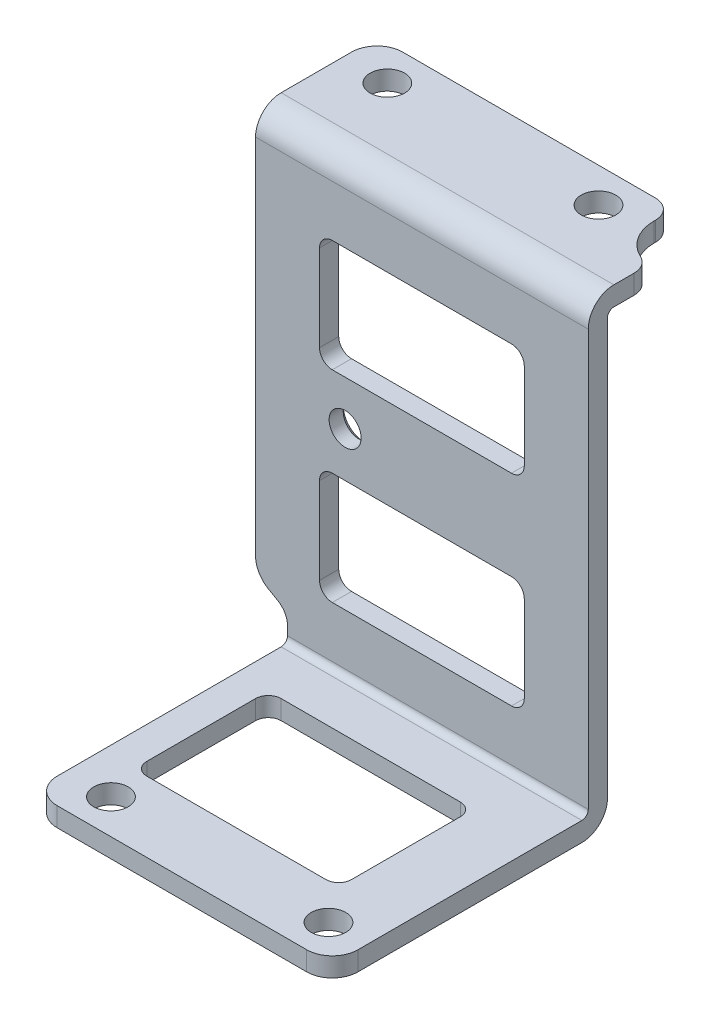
ISO-10303-21;
HEADER;
FILE_DESCRIPTION(('STEP AP214'),'2;1');
FILE_NAME('part.step','',(''),(''),'','','');
FILE_SCHEMA(('AUTOMOTIVE_DESIGN { 1 0 10303 214 1 1 1 1 }'));
ENDSEC;
DATA;
#1=APPLICATION_CONTEXT('core data for automotive mechanical design processes');
#2=APPLICATION_PROTOCOL_DEFINITION('international standard','automotive_design',2000,#1);
#3=PRODUCT_CONTEXT('',#1,'mechanical');
#4=PRODUCT('Part','Part','',(#3));
#5=PRODUCT_RELATED_PRODUCT_CATEGORY('part','',(#4));
#6=PRODUCT_DEFINITION_FORMATION('','',#4);
#7=PRODUCT_DEFINITION_CONTEXT('part definition',#1,'design');
#8=PRODUCT_DEFINITION('design','',#6,#7);
#9=PRODUCT_DEFINITION_SHAPE('','',#8);
#10=(LENGTH_UNIT() NAMED_UNIT(*) SI_UNIT(.MILLI.,.METRE.));
#11=(NAMED_UNIT(*) PLANE_ANGLE_UNIT() SI_UNIT($,.RADIAN.));
#12=(NAMED_UNIT(*) SI_UNIT($,.STERADIAN.) SOLID_ANGLE_UNIT());
#13=UNCERTAINTY_MEASURE_WITH_UNIT(LENGTH_MEASURE(1.E-05),#10,'distance_accuracy_value','');
#14=(GEOMETRIC_REPRESENTATION_CONTEXT(3) GLOBAL_UNCERTAINTY_ASSIGNED_CONTEXT((#13)) GLOBAL_UNIT_ASSIGNED_CONTEXT((#10,
#11,#12)) REPRESENTATION_CONTEXT('',''));
#15=CARTESIAN_POINT('',(0.,0.,0.));
#16=DIRECTION('',(0.,0.,1.));
#17=DIRECTION('',(1.,0.,0.));
#18=AXIS2_PLACEMENT_3D('',#15,#16,#17);
#19=CARTESIAN_POINT('',(45.75,19.25,-61.8));
#20=DIRECTION('',(-1.,0.,0.));
#21=DIRECTION('',(0.,0.,1.));
#22=AXIS2_PLACEMENT_3D('',#19,#20,#21);
#23=PLANE('',#22);
#24=DIRECTION('',(0.,-1.,0.));
#25=VECTOR('',#24,1.);
#26=CARTESIAN_POINT('',(45.75,19.25,-61.));
#27=LINE('',#26,#25);
#28=CARTESIAN_POINT('',(45.75,20.,-61.));
#29=VERTEX_POINT('',#28);
#30=CARTESIAN_POINT('',(45.75,18.5,-61.));
#31=VERTEX_POINT('',#30);
#32=EDGE_CURVE('E435',#29,#31,#27,.T.);
#33=ORIENTED_EDGE('',*,*,#32,.T.);
#34=DIRECTION('',(0.,0.,1.));
#35=VECTOR('',#34,1.);
#36=CARTESIAN_POINT('',(45.75,18.5,-55.1));
#37=LINE('',#36,#35);
#38=CARTESIAN_POINT('',(45.75,18.5,-61.1));
#39=VERTEX_POINT('',#38);
#40=EDGE_CURVE('E507',#31,#39,#37,.F.);
#41=ORIENTED_EDGE('',*,*,#40,.T.);
#42=DIRECTION('',(0.,1.,0.));
#43=VECTOR('',#42,1.);
#44=CARTESIAN_POINT('',(45.75,-64.0814,-61.1));
#45=LINE('',#44,#43);
#46=CARTESIAN_POINT('',(45.75,20.,-61.1));
#47=VERTEX_POINT('',#46);
#48=EDGE_CURVE('E429',#47,#39,#45,.F.);
#49=ORIENTED_EDGE('',*,*,#48,.F.);
#50=DIRECTION('',(0.,0.,1.));
#51=VECTOR('',#50,1.);
#52=CARTESIAN_POINT('',(45.75,20.,-61.8));
#53=LINE('',#52,#51);
#54=EDGE_CURVE('E324',#29,#47,#53,.F.);
#55=ORIENTED_EDGE('',*,*,#54,.F.);
#56=EDGE_LOOP('',(#33,#41,#49,#55));
#57=FACE_BOUND('',#56,.T.);
#58=ADVANCED_FACE('F17',(#57),#23,.F.);
#59=CARTESIAN_POINT('',(48.5,-16.5,-33.1));
#60=DIRECTION('',(0.,1.,0.));
#61=DIRECTION('',(0.,0.,1.));
#62=AXIS2_PLACEMENT_3D('',#59,#60,#61);
#63=PLANE('',#62);
#64=DIRECTION('',(0.,0.,1.));
#65=VECTOR('',#64,1.);
#66=CARTESIAN_POINT('',(27.5,-16.5,-43.85));
#67=LINE('',#66,#65);
#68=CARTESIAN_POINT('',(27.5,-16.5,-48.1));
#69=VERTEX_POINT('',#68);
#70=CARTESIAN_POINT('',(27.5,-16.5,-39.6));
#71=VERTEX_POINT('',#70);
#72=EDGE_CURVE('E465',#69,#71,#67,.T.);
#73=ORIENTED_EDGE('',*,*,#72,.T.);
#74=CARTESIAN_POINT('',(28.5,-16.5,-39.6));
#75=DIRECTION('',(0.,-1.,0.));
#76=DIRECTION('',(0.,0.,-1.));
#77=AXIS2_PLACEMENT_3D('',#74,#75,#76);
#78=CIRCLE('',#77,1.);
#79=CARTESIAN_POINT('',(28.5,-16.5,-38.6));
#80=VERTEX_POINT('',#79);
#81=EDGE_CURVE('E468',#71,#80,#78,.F.);
#82=ORIENTED_EDGE('',*,*,#81,.T.);
#83=DIRECTION('',(1.,0.,0.));
#84=VECTOR('',#83,1.);
#85=CARTESIAN_POINT('',(35.5,-16.5,-38.6));
#86=LINE('',#85,#84);
#87=CARTESIAN_POINT('',(42.5,-16.5,-38.6));
#88=VERTEX_POINT('',#87);
#89=EDGE_CURVE('E469',#80,#88,#86,.T.);
#90=ORIENTED_EDGE('',*,*,#89,.T.);
#91=CARTESIAN_POINT('',(42.5,-16.5,-39.6));
#92=DIRECTION('',(0.,-1.,0.));
#93=DIRECTION('',(0.,0.,-1.));
#94=AXIS2_PLACEMENT_3D('',#91,#92,#93);
#95=CIRCLE('',#94,1.);
#96=CARTESIAN_POINT('',(43.5,-16.5,-39.6));
#97=VERTEX_POINT('',#96);
#98=EDGE_CURVE('E472',#88,#97,#95,.F.);
#99=ORIENTED_EDGE('',*,*,#98,.T.);
#100=DIRECTION('',(0.,0.,-1.));
#101=VECTOR('',#100,1.);
#102=CARTESIAN_POINT('',(43.5,-16.5,-43.85));
#103=LINE('',#102,#101);
#104=CARTESIAN_POINT('',(43.5,-16.5,-48.1));
#105=VERTEX_POINT('',#104);
#106=EDGE_CURVE('E454',#97,#105,#103,.T.);
#107=ORIENTED_EDGE('',*,*,#106,.T.);
#108=CARTESIAN_POINT('',(42.5,-16.5,-48.1));
#109=DIRECTION('',(0.,-1.,0.));
#110=DIRECTION('',(0.,0.,-1.));
#111=AXIS2_PLACEMENT_3D('',#108,#109,#110);
#112=CIRCLE('',#111,1.);
#113=CARTESIAN_POINT('',(42.5,-16.5,-49.1));
#114=VERTEX_POINT('',#113);
#115=EDGE_CURVE('E451',#105,#114,#112,.F.);
#116=ORIENTED_EDGE('',*,*,#115,.T.);
#117=DIRECTION('',(-1.,0.,0.));
#118=VECTOR('',#117,1.);
#119=CARTESIAN_POINT('',(35.5,-16.5,-49.1));
#120=LINE('',#119,#118);
#121=CARTESIAN_POINT('',(28.5,-16.5,-49.1));
#122=VERTEX_POINT('',#121);
#123=EDGE_CURVE('E457',#114,#122,#120,.T.);
#124=ORIENTED_EDGE('',*,*,#123,.T.);
#125=CARTESIAN_POINT('',(28.5,-16.5,-48.1));
#126=DIRECTION('',(0.,-1.,0.));
#127=DIRECTION('',(0.,0.,-1.));
#128=AXIS2_PLACEMENT_3D('',#125,#126,#127);
#129=CIRCLE('',#128,1.);
#130=EDGE_CURVE('E460',#122,#69,#129,.F.);
#131=ORIENTED_EDGE('',*,*,#130,.T.);
#132=EDGE_LOOP('',(#73,#82,#90,#99,#107,#116,#124,#131));
#133=FACE_BOUND('',#132,.T.);
#134=CARTESIAN_POINT('',(28.5,-16.5,-35.8));
#135=DIRECTION('',(0.,-1.,0.));
#136=DIRECTION('',(0.,0.,-1.));
#137=AXIS2_PLACEMENT_3D('',#134,#135,#136);
#138=CIRCLE('',#137,1.35);
#139=CARTESIAN_POINT('',(28.5,-16.5,-37.15));
#140=VERTEX_POINT('',#139);
#141=EDGE_CURVE('E476',#140,#140,#138,.F.);
#142=ORIENTED_EDGE('',*,*,#141,.T.);
#143=EDGE_LOOP('',(#142));
#144=FACE_BOUND('',#143,.T.);
#145=CARTESIAN_POINT('',(45.5,-16.5,-35.8));
#146=DIRECTION('',(0.,-1.,0.));
#147=DIRECTION('',(0.,0.,-1.));
#148=AXIS2_PLACEMENT_3D('',#145,#146,#147);
#149=CIRCLE('',#148,1.35);
#150=CARTESIAN_POINT('',(45.5,-16.5,-37.15));
#151=VERTEX_POINT('',#150);
#152=EDGE_CURVE('E652',#151,#151,#149,.F.);
#153=ORIENTED_EDGE('',*,*,#152,.T.);
#154=EDGE_LOOP('',(#153));
#155=FACE_BOUND('',#154,.T.);
#156=CARTESIAN_POINT('',(27.,-16.5,-35.1));
#157=DIRECTION('',(0.,1.,0.));
#158=DIRECTION('',(0.,0.,1.));
#159=AXIS2_PLACEMENT_3D('',#156,#157,#158);
#160=CIRCLE('',#159,2.);
#161=CARTESIAN_POINT('',(25.,-16.5,-35.1));
#162=VERTEX_POINT('',#161);
#163=CARTESIAN_POINT('',(27.,-16.5,-33.1));
#164=VERTEX_POINT('',#163);
#165=EDGE_CURVE('E487',#162,#164,#160,.T.);
#166=ORIENTED_EDGE('',*,*,#165,.F.);
#167=DIRECTION('',(0.,0.,-1.));
#168=VECTOR('',#167,1.);
#169=CARTESIAN_POINT('',(25.,-16.5,-42.85));
#170=LINE('',#169,#168);
#171=CARTESIAN_POINT('',(25.,-16.5,-52.6));
#172=VERTEX_POINT('',#171);
#173=EDGE_CURVE('E488',#162,#172,#170,.T.);
#174=ORIENTED_EDGE('',*,*,#173,.T.);
#175=DIRECTION('',(-1.,0.,0.));
#176=VECTOR('',#175,1.);
#177=CARTESIAN_POINT('',(48.5,-16.5,-52.6));
#178=LINE('',#177,#176);
#179=CARTESIAN_POINT('',(48.5,-16.5,-52.6));
#180=VERTEX_POINT('',#179);
#181=EDGE_CURVE('E490',#180,#172,#178,.T.);
#182=ORIENTED_EDGE('',*,*,#181,.F.);
#183=DIRECTION('',(0.,0.,-1.));
#184=VECTOR('',#183,1.);
#185=CARTESIAN_POINT('',(48.5,-16.5,-42.85));
#186=LINE('',#185,#184);
#187=CARTESIAN_POINT('',(48.5,-16.5,-35.1));
#188=VERTEX_POINT('',#187);
#189=EDGE_CURVE('E504',#188,#180,#186,.T.);
#190=ORIENTED_EDGE('',*,*,#189,.F.);
#191=CARTESIAN_POINT('',(46.5,-16.5,-35.1));
#192=DIRECTION('',(0.,1.,0.));
#193=DIRECTION('',(0.,0.,1.));
#194=AXIS2_PLACEMENT_3D('',#191,#192,#193);
#195=CIRCLE('',#194,2.);
#196=CARTESIAN_POINT('',(46.5,-16.5,-33.1));
#197=VERTEX_POINT('',#196);
#198=EDGE_CURVE('E477',#197,#188,#195,.T.);
#199=ORIENTED_EDGE('',*,*,#198,.F.);
#200=DIRECTION('',(-1.,0.,0.));
#201=VECTOR('',#200,1.);
#202=CARTESIAN_POINT('',(35.5,-16.5,-33.1));
#203=LINE('',#202,#201);
#204=EDGE_CURVE('E483',#197,#164,#203,.T.);
#205=ORIENTED_EDGE('',*,*,#204,.T.);
#206=EDGE_LOOP('',(#166,#174,#182,#190,#199,#205));
#207=FACE_BOUND('',#206,.T.);
#208=ADVANCED_FACE('F1103',(#133,#144,#155,#207),#63,.F.);
#209=CARTESIAN_POINT('',(48.5,18.5,-55.1));
#210=DIRECTION('',(0.,1.,0.));
#211=DIRECTION('',(0.,0.,1.));
#212=AXIS2_PLACEMENT_3D('',#209,#210,#211);
#213=PLANE('',#212);
#214=CARTESIAN_POINT('',(26.,18.5,-59.9));
#215=DIRECTION('',(0.,-1.,0.));
#216=DIRECTION('',(0.,0.,-1.));
#217=AXIS2_PLACEMENT_3D('',#214,#215,#216);
#218=CIRCLE('',#217,1.35);
#219=CARTESIAN_POINT('',(26.,18.5,-61.25));
#220=VERTEX_POINT('',#219);
#221=EDGE_CURVE('E427',#220,#220,#218,.F.);
#222=ORIENTED_EDGE('',*,*,#221,.T.);
#223=EDGE_LOOP('',(#222));
#224=FACE_BOUND('',#223,.T.);
#225=CARTESIAN_POINT('',(42.5,18.5,-59.9));
#226=DIRECTION('',(0.,-1.,0.));
#227=DIRECTION('',(0.,0.,-1.));
#228=AXIS2_PLACEMENT_3D('',#225,#226,#227);
#229=CIRCLE('',#228,1.35);
#230=CARTESIAN_POINT('',(42.5,18.5,-61.25));
#231=VERTEX_POINT('',#230);
#232=EDGE_CURVE('E420',#231,#231,#229,.F.);
#233=ORIENTED_EDGE('',*,*,#232,.T.);
#234=EDGE_LOOP('',(#233));
#235=FACE_BOUND('',#234,.T.);
#236=CARTESIAN_POINT('',(49.,18.5,-61.));
#237=DIRECTION('',(0.,-1.,0.));
#238=DIRECTION('',(0.,0.,-1.));
#239=AXIS2_PLACEMENT_3D('',#236,#237,#238);
#240=CIRCLE('',#239,3.25);
#241=CARTESIAN_POINT('',(47.631578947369,18.5,-58.0521323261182));
#242=VERTEX_POINT('',#241);
#243=EDGE_CURVE('E432',#31,#242,#240,.F.);
#244=ORIENTED_EDGE('',*,*,#243,.T.);
#245=CARTESIAN_POINT('',(47.,18.5,-56.691578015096));
#246=DIRECTION('',(0.,1.,0.));
#247=DIRECTION('',(0.,0.,1.));
#248=AXIS2_PLACEMENT_3D('',#245,#246,#247);
#249=CIRCLE('',#248,1.5);
#250=CARTESIAN_POINT('',(48.5,18.5,-56.691578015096));
#251=VERTEX_POINT('',#250);
#252=EDGE_CURVE('E436',#251,#242,#249,.T.);
#253=ORIENTED_EDGE('',*,*,#252,.F.);
#254=DIRECTION('',(0.,0.,-1.));
#255=VECTOR('',#254,1.);
#256=CARTESIAN_POINT('',(48.5,18.5,-58.85));
#257=LINE('',#256,#255);
#258=CARTESIAN_POINT('',(48.5,18.5,-55.1));
#259=VERTEX_POINT('',#258);
#260=EDGE_CURVE('E416',#259,#251,#257,.T.);
#261=ORIENTED_EDGE('',*,*,#260,.F.);
#262=DIRECTION('',(-1.,0.,0.));
#263=VECTOR('',#262,1.);
#264=CARTESIAN_POINT('',(48.5,18.5,-55.1));
#265=LINE('',#264,#263);
#266=CARTESIAN_POINT('',(22.5,18.5,-55.1));
#267=VERTEX_POINT('',#266);
#268=EDGE_CURVE('E415',#259,#267,#265,.T.);
#269=ORIENTED_EDGE('',*,*,#268,.T.);
#270=DIRECTION('',(0.,0.,-1.));
#271=VECTOR('',#270,1.);
#272=CARTESIAN_POINT('',(22.5,18.5,-58.85));
#273=LINE('',#272,#271);
#274=CARTESIAN_POINT('',(22.5,18.5,-60.6));
#275=VERTEX_POINT('',#274);
#276=EDGE_CURVE('E442',#267,#275,#273,.T.);
#277=ORIENTED_EDGE('',*,*,#276,.T.);
#278=CARTESIAN_POINT('',(24.5,18.5,-60.6));
#279=DIRECTION('',(0.,1.,0.));
#280=DIRECTION('',(0.,0.,1.));
#281=AXIS2_PLACEMENT_3D('',#278,#279,#280);
#282=CIRCLE('',#281,2.);
#283=CARTESIAN_POINT('',(24.5,18.5,-62.6));
#284=VERTEX_POINT('',#283);
#285=EDGE_CURVE('E443',#284,#275,#282,.T.);
#286=ORIENTED_EDGE('',*,*,#285,.F.);
#287=DIRECTION('',(-1.,0.,0.));
#288=VECTOR('',#287,1.);
#289=CARTESIAN_POINT('',(35.5,18.5,-62.6));
#290=LINE('',#289,#288);
#291=CARTESIAN_POINT('',(44.25,18.5,-62.6));
#292=VERTEX_POINT('',#291);
#293=EDGE_CURVE('E447',#292,#284,#290,.T.);
#294=ORIENTED_EDGE('',*,*,#293,.F.);
#295=CARTESIAN_POINT('',(44.25,18.5,-61.1));
#296=DIRECTION('',(0.,1.,0.));
#297=DIRECTION('',(0.,0.,1.));
#298=AXIS2_PLACEMENT_3D('',#295,#296,#297);
#299=CIRCLE('',#298,1.5);
#300=EDGE_CURVE('E428',#39,#292,#299,.T.);
#301=ORIENTED_EDGE('',*,*,#300,.F.);
#302=ORIENTED_EDGE('',*,*,#40,.F.);
#303=EDGE_LOOP('',(#244,#253,#261,#269,#277,#286,#294,#301,#302));
#304=FACE_BOUND('',#303,.T.);
#305=ADVANCED_FACE('F756',(#224,#235,#304),#213,.F.);
#306=CARTESIAN_POINT('',(27.,-64.0814,-35.1));
#307=DIRECTION('',(0.,1.,0.));
#308=DIRECTION('',(0.,0.,1.));
#309=AXIS2_PLACEMENT_3D('',#306,#307,#308);
#310=CYLINDRICAL_SURFACE('',#309,2.);
#311=DIRECTION('',(0.,1.,0.));
#312=VECTOR('',#311,1.);
#313=CARTESIAN_POINT('',(27.,-15.75,-33.1));
#314=LINE('',#313,#312);
#315=CARTESIAN_POINT('',(27.,-15.,-33.1));
#316=VERTEX_POINT('',#315);
#317=EDGE_CURVE('E481',#164,#316,#314,.T.);
#318=ORIENTED_EDGE('',*,*,#317,.T.);
#319=CARTESIAN_POINT('',(27.,-15.,-35.1));
#320=DIRECTION('',(0.,1.,0.));
#321=DIRECTION('',(0.,0.,1.));
#322=AXIS2_PLACEMENT_3D('',#319,#320,#321);
#323=CIRCLE('',#322,2.);
#324=CARTESIAN_POINT('',(25.,-15.,-35.1));
#325=VERTEX_POINT('',#324);
#326=EDGE_CURVE('E628',#325,#316,#323,.T.);
#327=ORIENTED_EDGE('',*,*,#326,.F.);
#328=DIRECTION('',(0.,1.,0.));
#329=VECTOR('',#328,1.);
#330=CARTESIAN_POINT('',(25.,-64.0814,-35.1));
#331=LINE('',#330,#329);
#332=EDGE_CURVE('E484',#325,#162,#331,.F.);
#333=ORIENTED_EDGE('',*,*,#332,.T.);
#334=ORIENTED_EDGE('',*,*,#165,.T.);
#335=EDGE_LOOP('',(#318,#327,#333,#334));
#336=FACE_BOUND('',#335,.T.);
#337=ADVANCED_FACE('F1088',(#336),#310,.T.);
#338=CARTESIAN_POINT('',(35.5,-15.75,-33.1));
#339=DIRECTION('',(0.,0.,-1.));
#340=DIRECTION('',(-1.,0.,0.));
#341=AXIS2_PLACEMENT_3D('',#338,#339,#340);
#342=PLANE('',#341);
#343=ORIENTED_EDGE('',*,*,#317,.F.);
#344=ORIENTED_EDGE('',*,*,#204,.F.);
#345=DIRECTION('',(0.,1.,0.));
#346=VECTOR('',#345,1.);
#347=CARTESIAN_POINT('',(46.5,-64.0814,-33.1));
#348=LINE('',#347,#346);
#349=CARTESIAN_POINT('',(46.5,-15.,-33.1));
#350=VERTEX_POINT('',#349);
#351=EDGE_CURVE('E478',#350,#197,#348,.F.);
#352=ORIENTED_EDGE('',*,*,#351,.F.);
#353=DIRECTION('',(1.,0.,0.));
#354=VECTOR('',#353,1.);
#355=CARTESIAN_POINT('',(48.5,-15.,-33.1));
#356=LINE('',#355,#354);
#357=EDGE_CURVE('E627',#316,#350,#356,.T.);
#358=ORIENTED_EDGE('',*,*,#357,.F.);
#359=EDGE_LOOP('',(#343,#344,#352,#358));
#360=FACE_BOUND('',#359,.T.);
#361=ADVANCED_FACE('F1080',(#360),#342,.F.);
#362=CARTESIAN_POINT('',(46.5,-64.0814,-35.1));
#363=DIRECTION('',(0.,1.,0.));
#364=DIRECTION('',(0.,0.,1.));
#365=AXIS2_PLACEMENT_3D('',#362,#363,#364);
#366=CYLINDRICAL_SURFACE('',#365,2.);
#367=DIRECTION('',(0.,1.,0.));
#368=VECTOR('',#367,1.);
#369=CARTESIAN_POINT('',(48.5,-64.0814,-35.1));
#370=LINE('',#369,#368);
#371=CARTESIAN_POINT('',(48.5,-15.,-35.1));
#372=VERTEX_POINT('',#371);
#373=EDGE_CURVE('E473',#188,#372,#370,.T.);
#374=ORIENTED_EDGE('',*,*,#373,.T.);
#375=CARTESIAN_POINT('',(46.5,-15.,-35.1));
#376=DIRECTION('',(0.,1.,0.));
#377=DIRECTION('',(0.,0.,1.));
#378=AXIS2_PLACEMENT_3D('',#375,#376,#377);
#379=CIRCLE('',#378,2.);
#380=EDGE_CURVE('E624',#350,#372,#379,.T.);
#381=ORIENTED_EDGE('',*,*,#380,.F.);
#382=ORIENTED_EDGE('',*,*,#351,.T.);
#383=ORIENTED_EDGE('',*,*,#198,.T.);
#384=EDGE_LOOP('',(#374,#381,#382,#383));
#385=FACE_BOUND('',#384,.T.);
#386=ADVANCED_FACE('F1072',(#385),#366,.T.);
#387=CARTESIAN_POINT('',(28.5,-15.75,-35.8));
#388=DIRECTION('',(0.,-1.,0.));
#389=DIRECTION('',(0.,0.,-1.));
#390=AXIS2_PLACEMENT_3D('',#387,#388,#389);
#391=CYLINDRICAL_SURFACE('',#390,1.35);
#392=ORIENTED_EDGE('',*,*,#141,.F.);
#393=EDGE_LOOP('',(#392));
#394=FACE_BOUND('',#393,.T.);
#395=CARTESIAN_POINT('',(28.5,-15.,-35.8));
#396=DIRECTION('',(0.,-1.,0.));
#397=DIRECTION('',(0.,0.,-1.));
#398=AXIS2_PLACEMENT_3D('',#395,#396,#397);
#399=CIRCLE('',#398,1.35);
#400=CARTESIAN_POINT('',(28.5,-15.,-37.15));
#401=VERTEX_POINT('',#400);
#402=EDGE_CURVE('E621',#401,#401,#399,.T.);
#403=ORIENTED_EDGE('',*,*,#402,.F.);
#404=EDGE_LOOP('',(#403));
#405=FACE_BOUND('',#404,.T.);
#406=ADVANCED_FACE('F1064',(#394,#405),#391,.F.);
#407=CARTESIAN_POINT('',(45.5,-15.75,-35.8));
#408=DIRECTION('',(0.,-1.,0.));
#409=DIRECTION('',(0.,0.,-1.));
#410=AXIS2_PLACEMENT_3D('',#407,#408,#409);
#411=CYLINDRICAL_SURFACE('',#410,1.35);
#412=ORIENTED_EDGE('',*,*,#152,.F.);
#413=EDGE_LOOP('',(#412));
#414=FACE_BOUND('',#413,.T.);
#415=CARTESIAN_POINT('',(45.5,-15.,-35.8));
#416=DIRECTION('',(0.,-1.,0.));
#417=DIRECTION('',(0.,0.,-1.));
#418=AXIS2_PLACEMENT_3D('',#415,#416,#417);
#419=CIRCLE('',#418,1.35);
#420=CARTESIAN_POINT('',(45.5,-15.,-37.15));
#421=VERTEX_POINT('',#420);
#422=EDGE_CURVE('E618',#421,#421,#419,.T.);
#423=ORIENTED_EDGE('',*,*,#422,.F.);
#424=EDGE_LOOP('',(#423));
#425=FACE_BOUND('',#424,.T.);
#426=ADVANCED_FACE('F1056',(#414,#425),#411,.F.);
#427=CARTESIAN_POINT('',(42.5,67.5814,-39.6));
#428=DIRECTION('',(0.,-1.,0.));
#429=DIRECTION('',(0.,0.,-1.));
#430=AXIS2_PLACEMENT_3D('',#427,#428,#429);
#431=CYLINDRICAL_SURFACE('',#430,1.);
#432=DIRECTION('',(0.,1.,0.));
#433=VECTOR('',#432,1.);
#434=CARTESIAN_POINT('',(42.5,-15.75,-38.6));
#435=LINE('',#434,#433);
#436=CARTESIAN_POINT('',(42.5,-15.,-38.6));
#437=VERTEX_POINT('',#436);
#438=EDGE_CURVE('E470',#88,#437,#435,.T.);
#439=ORIENTED_EDGE('',*,*,#438,.T.);
#440=CARTESIAN_POINT('',(42.5,-15.,-39.6));
#441=DIRECTION('',(0.,-1.,0.));
#442=DIRECTION('',(0.,0.,-1.));
#443=AXIS2_PLACEMENT_3D('',#440,#441,#442);
#444=CIRCLE('',#443,1.);
#445=CARTESIAN_POINT('',(43.5,-15.,-39.6));
#446=VERTEX_POINT('',#445);
#447=EDGE_CURVE('E615',#446,#437,#444,.T.);
#448=ORIENTED_EDGE('',*,*,#447,.F.);
#449=DIRECTION('',(0.,1.,0.));
#450=VECTOR('',#449,1.);
#451=CARTESIAN_POINT('',(43.5,-15.75,-39.6));
#452=LINE('',#451,#450);
#453=EDGE_CURVE('E450',#446,#97,#452,.F.);
#454=ORIENTED_EDGE('',*,*,#453,.T.);
#455=ORIENTED_EDGE('',*,*,#98,.F.);
#456=EDGE_LOOP('',(#439,#448,#454,#455));
#457=FACE_BOUND('',#456,.T.);
#458=ADVANCED_FACE('F1048',(#457),#431,.F.);
#459=CARTESIAN_POINT('',(35.5,-15.75,-38.6));
#460=DIRECTION('',(0.,0.,1.));
#461=DIRECTION('',(1.,0.,0.));
#462=AXIS2_PLACEMENT_3D('',#459,#460,#461);
#463=PLANE('',#462);
#464=DIRECTION('',(0.,-1.,0.));
#465=VECTOR('',#464,1.);
#466=CARTESIAN_POINT('',(28.5,67.5814,-38.6));
#467=LINE('',#466,#465);
#468=CARTESIAN_POINT('',(28.5,-15.,-38.6));
#469=VERTEX_POINT('',#468);
#470=EDGE_CURVE('E466',#80,#469,#467,.F.);
#471=ORIENTED_EDGE('',*,*,#470,.T.);
#472=DIRECTION('',(1.,0.,0.));
#473=VECTOR('',#472,1.);
#474=CARTESIAN_POINT('',(48.5,-15.,-38.6));
#475=LINE('',#474,#473);
#476=EDGE_CURVE('E614',#437,#469,#475,.F.);
#477=ORIENTED_EDGE('',*,*,#476,.F.);
#478=ORIENTED_EDGE('',*,*,#438,.F.);
#479=ORIENTED_EDGE('',*,*,#89,.F.);
#480=EDGE_LOOP('',(#471,#477,#478,#479));
#481=FACE_BOUND('',#480,.T.);
#482=ADVANCED_FACE('F1040',(#481),#463,.F.);
#483=CARTESIAN_POINT('',(28.5,67.5814,-39.6));
#484=DIRECTION('',(0.,-1.,0.));
#485=DIRECTION('',(0.,0.,-1.));
#486=AXIS2_PLACEMENT_3D('',#483,#484,#485);
#487=CYLINDRICAL_SURFACE('',#486,1.);
#488=DIRECTION('',(0.,1.,0.));
#489=VECTOR('',#488,1.);
#490=CARTESIAN_POINT('',(27.5,-15.75,-39.6));
#491=LINE('',#490,#489);
#492=CARTESIAN_POINT('',(27.5,-15.,-39.6));
#493=VERTEX_POINT('',#492);
#494=EDGE_CURVE('E463',#71,#493,#491,.T.);
#495=ORIENTED_EDGE('',*,*,#494,.T.);
#496=CARTESIAN_POINT('',(28.5,-15.,-39.6));
#497=DIRECTION('',(0.,-1.,0.));
#498=DIRECTION('',(0.,0.,-1.));
#499=AXIS2_PLACEMENT_3D('',#496,#497,#498);
#500=CIRCLE('',#499,1.);
#501=EDGE_CURVE('E611',#469,#493,#500,.T.);
#502=ORIENTED_EDGE('',*,*,#501,.F.);
#503=ORIENTED_EDGE('',*,*,#470,.F.);
#504=ORIENTED_EDGE('',*,*,#81,.F.);
#505=EDGE_LOOP('',(#495,#502,#503,#504));
#506=FACE_BOUND('',#505,.T.);
#507=ADVANCED_FACE('F1032',(#506),#487,.F.);
#508=CARTESIAN_POINT('',(27.5,-15.75,-43.85));
#509=DIRECTION('',(-1.,0.,0.));
#510=DIRECTION('',(0.,0.,1.));
#511=AXIS2_PLACEMENT_3D('',#508,#509,#510);
#512=PLANE('',#511);
#513=ORIENTED_EDGE('',*,*,#494,.F.);
#514=ORIENTED_EDGE('',*,*,#72,.F.);
#515=DIRECTION('',(0.,-1.,0.));
#516=VECTOR('',#515,1.);
#517=CARTESIAN_POINT('',(27.5,67.5814,-48.1));
#518=LINE('',#517,#516);
#519=CARTESIAN_POINT('',(27.5,-15.,-48.1));
#520=VERTEX_POINT('',#519);
#521=EDGE_CURVE('E461',#69,#520,#518,.F.);
#522=ORIENTED_EDGE('',*,*,#521,.T.);
#523=DIRECTION('',(0.,0.,1.));
#524=VECTOR('',#523,1.);
#525=CARTESIAN_POINT('',(27.5,-15.,-33.1));
#526=LINE('',#525,#524);
#527=EDGE_CURVE('E610',#493,#520,#526,.F.);
#528=ORIENTED_EDGE('',*,*,#527,.F.);
#529=EDGE_LOOP('',(#513,#514,#522,#528));
#530=FACE_BOUND('',#529,.T.);
#531=ADVANCED_FACE('F1024',(#530),#512,.F.);
#532=CARTESIAN_POINT('',(28.5,67.5814,-48.1));
#533=DIRECTION('',(0.,-1.,0.));
#534=DIRECTION('',(0.,0.,-1.));
#535=AXIS2_PLACEMENT_3D('',#532,#533,#534);
#536=CYLINDRICAL_SURFACE('',#535,1.);
#537=DIRECTION('',(0.,1.,0.));
#538=VECTOR('',#537,1.);
#539=CARTESIAN_POINT('',(28.5,-15.75,-49.1));
#540=LINE('',#539,#538);
#541=CARTESIAN_POINT('',(28.5,-15.,-49.1));
#542=VERTEX_POINT('',#541);
#543=EDGE_CURVE('E458',#122,#542,#540,.T.);
#544=ORIENTED_EDGE('',*,*,#543,.T.);
#545=CARTESIAN_POINT('',(28.5,-15.,-48.1));
#546=DIRECTION('',(0.,-1.,0.));
#547=DIRECTION('',(0.,0.,-1.));
#548=AXIS2_PLACEMENT_3D('',#545,#546,#547);
#549=CIRCLE('',#548,1.);
#550=EDGE_CURVE('E607',#520,#542,#549,.T.);
#551=ORIENTED_EDGE('',*,*,#550,.F.);
#552=ORIENTED_EDGE('',*,*,#521,.F.);
#553=ORIENTED_EDGE('',*,*,#130,.F.);
#554=EDGE_LOOP('',(#544,#551,#552,#553));
#555=FACE_BOUND('',#554,.T.);
#556=ADVANCED_FACE('F1016',(#555),#536,.F.);
#557=CARTESIAN_POINT('',(35.5,-15.75,-49.1));
#558=DIRECTION('',(0.,0.,-1.));
#559=DIRECTION('',(-1.,0.,0.));
#560=AXIS2_PLACEMENT_3D('',#557,#558,#559);
#561=PLANE('',#560);
#562=DIRECTION('',(0.,-1.,0.));
#563=VECTOR('',#562,1.);
#564=CARTESIAN_POINT('',(42.5,67.5814,-49.1));
#565=LINE('',#564,#563);
#566=CARTESIAN_POINT('',(42.5,-15.,-49.1));
#567=VERTEX_POINT('',#566);
#568=EDGE_CURVE('E455',#114,#567,#565,.F.);
#569=ORIENTED_EDGE('',*,*,#568,.T.);
#570=DIRECTION('',(1.,0.,0.));
#571=VECTOR('',#570,1.);
#572=CARTESIAN_POINT('',(48.5,-15.,-49.1));
#573=LINE('',#572,#571);
#574=EDGE_CURVE('E606',#542,#567,#573,.T.);
#575=ORIENTED_EDGE('',*,*,#574,.F.);
#576=ORIENTED_EDGE('',*,*,#543,.F.);
#577=ORIENTED_EDGE('',*,*,#123,.F.);
#578=EDGE_LOOP('',(#569,#575,#576,#577));
#579=FACE_BOUND('',#578,.T.);
#580=ADVANCED_FACE('F1008',(#579),#561,.F.);
#581=CARTESIAN_POINT('',(42.5,67.5814,-48.1));
#582=DIRECTION('',(0.,-1.,0.));
#583=DIRECTION('',(0.,0.,-1.));
#584=AXIS2_PLACEMENT_3D('',#581,#582,#583);
#585=CYLINDRICAL_SURFACE('',#584,1.);
#586=DIRECTION('',(0.,1.,0.));
#587=VECTOR('',#586,1.);
#588=CARTESIAN_POINT('',(43.5,-15.75,-48.1));
#589=LINE('',#588,#587);
#590=CARTESIAN_POINT('',(43.5,-15.,-48.1));
#591=VERTEX_POINT('',#590);
#592=EDGE_CURVE('E448',#105,#591,#589,.T.);
#593=ORIENTED_EDGE('',*,*,#592,.T.);
#594=CARTESIAN_POINT('',(42.5,-15.,-48.1));
#595=DIRECTION('',(0.,-1.,0.));
#596=DIRECTION('',(0.,0.,-1.));
#597=AXIS2_PLACEMENT_3D('',#594,#595,#596);
#598=CIRCLE('',#597,1.);
#599=EDGE_CURVE('E602',#567,#591,#598,.T.);
#600=ORIENTED_EDGE('',*,*,#599,.F.);
#601=ORIENTED_EDGE('',*,*,#568,.F.);
#602=ORIENTED_EDGE('',*,*,#115,.F.);
#603=EDGE_LOOP('',(#593,#600,#601,#602));
#604=FACE_BOUND('',#603,.T.);
#605=ADVANCED_FACE('F1000',(#604),#585,.F.);
#606=CARTESIAN_POINT('',(43.5,-15.75,-43.85));
#607=DIRECTION('',(1.,0.,0.));
#608=DIRECTION('',(0.,0.,-1.));
#609=AXIS2_PLACEMENT_3D('',#606,#607,#608);
#610=PLANE('',#609);
#611=ORIENTED_EDGE('',*,*,#453,.F.);
#612=DIRECTION('',(0.,0.,1.));
#613=VECTOR('',#612,1.);
#614=CARTESIAN_POINT('',(43.5,-15.,-33.1));
#615=LINE('',#614,#613);
#616=EDGE_CURVE('E605',#591,#446,#615,.T.);
#617=ORIENTED_EDGE('',*,*,#616,.F.);
#618=ORIENTED_EDGE('',*,*,#592,.F.);
#619=ORIENTED_EDGE('',*,*,#106,.F.);
#620=EDGE_LOOP('',(#611,#617,#618,#619));
#621=FACE_BOUND('',#620,.T.);
#622=ADVANCED_FACE('F992',(#621),#610,.F.);
#623=CARTESIAN_POINT('',(35.5,19.25,-62.6));
#624=DIRECTION('',(0.,0.,-1.));
#625=DIRECTION('',(-1.,0.,0.));
#626=AXIS2_PLACEMENT_3D('',#623,#624,#625);
#627=PLANE('',#626);
#628=DIRECTION('',(1.,0.,0.));
#629=VECTOR('',#628,1.);
#630=CARTESIAN_POINT('',(48.5,20.,-62.6));
#631=LINE('',#630,#629);
#632=CARTESIAN_POINT('',(44.25,20.,-62.6));
#633=VERTEX_POINT('',#632);
#634=CARTESIAN_POINT('',(24.5,20.,-62.6));
#635=VERTEX_POINT('',#634);
#636=EDGE_CURVE('E601',#633,#635,#631,.F.);
#637=ORIENTED_EDGE('',*,*,#636,.F.);
#638=DIRECTION('',(0.,1.,0.));
#639=VECTOR('',#638,1.);
#640=CARTESIAN_POINT('',(44.25,-64.0814,-62.6));
#641=LINE('',#640,#639);
#642=EDGE_CURVE('E424',#292,#633,#641,.T.);
#643=ORIENTED_EDGE('',*,*,#642,.F.);
#644=ORIENTED_EDGE('',*,*,#293,.T.);
#645=DIRECTION('',(0.,1.,0.));
#646=VECTOR('',#645,1.);
#647=CARTESIAN_POINT('',(24.5,-64.0814,-62.6));
#648=LINE('',#647,#646);
#649=EDGE_CURVE('E444',#635,#284,#648,.F.);
#650=ORIENTED_EDGE('',*,*,#649,.F.);
#651=EDGE_LOOP('',(#637,#643,#644,#650));
#652=FACE_BOUND('',#651,.T.);
#653=ADVANCED_FACE('F985',(#652),#627,.T.);
#654=CARTESIAN_POINT('',(24.5,-64.0814,-60.6));
#655=DIRECTION('',(0.,1.,0.));
#656=DIRECTION('',(0.,0.,1.));
#657=AXIS2_PLACEMENT_3D('',#654,#655,#656);
#658=CYLINDRICAL_SURFACE('',#657,2.);
#659=DIRECTION('',(0.,1.,0.));
#660=VECTOR('',#659,1.);
#661=CARTESIAN_POINT('',(22.5,19.25,-60.6));
#662=LINE('',#661,#660);
#663=CARTESIAN_POINT('',(22.5,20.,-60.6));
#664=VERTEX_POINT('',#663);
#665=EDGE_CURVE('E440',#275,#664,#662,.T.);
#666=ORIENTED_EDGE('',*,*,#665,.T.);
#667=CARTESIAN_POINT('',(24.5,20.,-60.6));
#668=DIRECTION('',(0.,1.,0.));
#669=DIRECTION('',(0.,0.,1.));
#670=AXIS2_PLACEMENT_3D('',#667,#668,#669);
#671=CIRCLE('',#670,2.);
#672=EDGE_CURVE('E597',#635,#664,#671,.T.);
#673=ORIENTED_EDGE('',*,*,#672,.F.);
#674=ORIENTED_EDGE('',*,*,#649,.T.);
#675=ORIENTED_EDGE('',*,*,#285,.T.);
#676=EDGE_LOOP('',(#666,#673,#674,#675));
#677=FACE_BOUND('',#676,.T.);
#678=ADVANCED_FACE('F753',(#677),#658,.T.);
#679=CARTESIAN_POINT('',(47.,-64.0814,-56.691578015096));
#680=DIRECTION('',(0.,1.,0.));
#681=DIRECTION('',(0.,0.,1.));
#682=AXIS2_PLACEMENT_3D('',#679,#680,#681);
#683=CYLINDRICAL_SURFACE('',#682,1.5);
#684=DIRECTION('',(0.,-1.,0.));
#685=VECTOR('',#684,1.);
#686=CARTESIAN_POINT('',(47.6315789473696,19.25,-58.0521323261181));
#687=LINE('',#686,#685);
#688=CARTESIAN_POINT('',(47.6315789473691,20.,-58.0521323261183));
#689=VERTEX_POINT('',#688);
#690=EDGE_CURVE('E433',#242,#689,#687,.F.);
#691=ORIENTED_EDGE('',*,*,#690,.T.);
#692=CARTESIAN_POINT('',(47.,20.,-56.691578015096));
#693=DIRECTION('',(0.,1.,0.));
#694=DIRECTION('',(0.,0.,1.));
#695=AXIS2_PLACEMENT_3D('',#692,#693,#694);
#696=CIRCLE('',#695,1.5);
#697=CARTESIAN_POINT('',(48.5,20.,-56.691578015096));
#698=VERTEX_POINT('',#697);
#699=EDGE_CURVE('E593',#698,#689,#696,.T.);
#700=ORIENTED_EDGE('',*,*,#699,.F.);
#701=DIRECTION('',(0.,1.,0.));
#702=VECTOR('',#701,1.);
#703=CARTESIAN_POINT('',(48.5,19.25,-56.691578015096));
#704=LINE('',#703,#702);
#705=EDGE_CURVE('E419',#251,#698,#704,.T.);
#706=ORIENTED_EDGE('',*,*,#705,.F.);
#707=ORIENTED_EDGE('',*,*,#252,.T.);
#708=EDGE_LOOP('',(#691,#700,#706,#707));
#709=FACE_BOUND('',#708,.T.);
#710=ADVANCED_FACE('F970',(#709),#683,.T.);
#711=CARTESIAN_POINT('',(49.,19.25,-61.));
#712=DIRECTION('',(0.,-1.,0.));
#713=DIRECTION('',(0.,0.,-1.));
#714=AXIS2_PLACEMENT_3D('',#711,#712,#713);
#715=CYLINDRICAL_SURFACE('',#714,3.25);
#716=ORIENTED_EDGE('',*,*,#32,.F.);
#717=CARTESIAN_POINT('',(49.,20.,-61.));
#718=DIRECTION('',(0.,-1.,0.));
#719=DIRECTION('',(0.,0.,-1.));
#720=AXIS2_PLACEMENT_3D('',#717,#718,#719);
#721=CIRCLE('',#720,3.25);
#722=EDGE_CURVE('E590',#689,#29,#721,.T.);
#723=ORIENTED_EDGE('',*,*,#722,.F.);
#724=ORIENTED_EDGE('',*,*,#690,.F.);
#725=ORIENTED_EDGE('',*,*,#243,.F.);
#726=EDGE_LOOP('',(#716,#723,#724,#725));
#727=FACE_BOUND('',#726,.T.);
#728=ADVANCED_FACE('F962',(#727),#715,.F.);
#729=CARTESIAN_POINT('',(44.25,-64.0814,-61.1));
#730=DIRECTION('',(0.,1.,0.));
#731=DIRECTION('',(0.,0.,1.));
#732=AXIS2_PLACEMENT_3D('',#729,#730,#731);
#733=CYLINDRICAL_SURFACE('',#732,1.5);
#734=ORIENTED_EDGE('',*,*,#642,.T.);
#735=CARTESIAN_POINT('',(44.25,20.,-61.1));
#736=DIRECTION('',(0.,1.,0.));
#737=DIRECTION('',(0.,0.,1.));
#738=AXIS2_PLACEMENT_3D('',#735,#736,#737);
#739=CIRCLE('',#738,1.5);
#740=EDGE_CURVE('E587',#47,#633,#739,.T.);
#741=ORIENTED_EDGE('',*,*,#740,.F.);
#742=ORIENTED_EDGE('',*,*,#48,.T.);
#743=ORIENTED_EDGE('',*,*,#300,.T.);
#744=EDGE_LOOP('',(#734,#741,#742,#743));
#745=FACE_BOUND('',#744,.T.);
#746=ADVANCED_FACE('F954',(#745),#733,.T.);
#747=CARTESIAN_POINT('',(26.,19.25,-59.9));
#748=DIRECTION('',(0.,-1.,0.));
#749=DIRECTION('',(0.,0.,-1.));
#750=AXIS2_PLACEMENT_3D('',#747,#748,#749);
#751=CYLINDRICAL_SURFACE('',#750,1.35);
#752=ORIENTED_EDGE('',*,*,#221,.F.);
#753=EDGE_LOOP('',(#752));
#754=FACE_BOUND('',#753,.T.);
#755=CARTESIAN_POINT('',(26.,20.,-59.9));
#756=DIRECTION('',(0.,-1.,0.));
#757=DIRECTION('',(0.,0.,-1.));
#758=AXIS2_PLACEMENT_3D('',#755,#756,#757);
#759=CIRCLE('',#758,1.35);
#760=CARTESIAN_POINT('',(26.,20.,-61.25));
#761=VERTEX_POINT('',#760);
#762=EDGE_CURVE('E584',#761,#761,#759,.T.);
#763=ORIENTED_EDGE('',*,*,#762,.F.);
#764=EDGE_LOOP('',(#763));
#765=FACE_BOUND('',#764,.T.);
#766=ADVANCED_FACE('F946',(#754,#765),#751,.F.);
#767=CARTESIAN_POINT('',(42.5,19.25,-59.9));
#768=DIRECTION('',(0.,-1.,0.));
#769=DIRECTION('',(0.,0.,-1.));
#770=AXIS2_PLACEMENT_3D('',#767,#768,#769);
#771=CYLINDRICAL_SURFACE('',#770,1.35);
#772=ORIENTED_EDGE('',*,*,#232,.F.);
#773=EDGE_LOOP('',(#772));
#774=FACE_BOUND('',#773,.T.);
#775=CARTESIAN_POINT('',(42.5,20.,-59.9));
#776=DIRECTION('',(0.,-1.,0.));
#777=DIRECTION('',(0.,0.,-1.));
#778=AXIS2_PLACEMENT_3D('',#775,#776,#777);
#779=CIRCLE('',#778,1.35);
#780=CARTESIAN_POINT('',(42.5,20.,-61.25));
#781=VERTEX_POINT('',#780);
#782=EDGE_CURVE('E581',#781,#781,#779,.T.);
#783=ORIENTED_EDGE('',*,*,#782,.F.);
#784=EDGE_LOOP('',(#783));
#785=FACE_BOUND('',#784,.T.);
#786=ADVANCED_FACE('F939',(#774,#785),#771,.F.);
#787=CARTESIAN_POINT('',(48.5,-14.5,-52.6));
#788=DIRECTION('',(-1.,0.,0.));
#789=DIRECTION('',(0.,0.,1.));
#790=AXIS2_PLACEMENT_3D('',#787,#788,#789);
#791=CYLINDRICAL_SURFACE('',#790,2.);
#792=ORIENTED_EDGE('',*,*,#181,.T.);
#793=CARTESIAN_POINT('',(25.,-14.5,-52.6));
#794=DIRECTION('',(-1.,0.,0.));
#795=DIRECTION('',(0.,0.,1.));
#796=AXIS2_PLACEMENT_3D('',#793,#794,#795);
#797=CIRCLE('',#796,2.);
#798=CARTESIAN_POINT('',(25.,-14.5,-54.6));
#799=VERTEX_POINT('',#798);
#800=EDGE_CURVE('E423',#172,#799,#797,.F.);
#801=ORIENTED_EDGE('',*,*,#800,.T.);
#802=DIRECTION('',(1.,0.,0.));
#803=VECTOR('',#802,1.);
#804=CARTESIAN_POINT('',(48.5,-14.5,-54.6));
#805=LINE('',#804,#803);
#806=CARTESIAN_POINT('',(48.5,-14.5,-54.6));
#807=VERTEX_POINT('',#806);
#808=EDGE_CURVE('E403',#799,#807,#805,.T.);
#809=ORIENTED_EDGE('',*,*,#808,.T.);
#810=CARTESIAN_POINT('',(48.5,-14.5,-52.6));
#811=DIRECTION('',(-1.,0.,0.));
#812=DIRECTION('',(0.,0.,1.));
#813=AXIS2_PLACEMENT_3D('',#810,#811,#812);
#814=CIRCLE('',#813,2.);
#815=EDGE_CURVE('E439',#807,#180,#814,.T.);
#816=ORIENTED_EDGE('',*,*,#815,.T.);
#817=EDGE_LOOP('',(#792,#801,#809,#816));
#818=FACE_BOUND('',#817,.T.);
#819=ADVANCED_FACE('F763',(#818),#791,.T.);
#820=CARTESIAN_POINT('',(48.5,18.,-55.1));
#821=DIRECTION('',(-1.,0.,0.));
#822=DIRECTION('',(0.,0.,1.));
#823=AXIS2_PLACEMENT_3D('',#820,#821,#822);
#824=CYLINDRICAL_SURFACE('',#823,0.5);
#825=CARTESIAN_POINT('',(22.5,18.,-55.1));
#826=DIRECTION('',(-1.,0.,0.));
#827=DIRECTION('',(0.,0.,1.));
#828=AXIS2_PLACEMENT_3D('',#825,#826,#827);
#829=CIRCLE('',#828,0.5);
#830=CARTESIAN_POINT('',(22.5,18.,-54.6));
#831=VERTEX_POINT('',#830);
#832=EDGE_CURVE('E579',#831,#267,#829,.T.);
#833=ORIENTED_EDGE('',*,*,#832,.T.);
#834=ORIENTED_EDGE('',*,*,#268,.F.);
#835=CARTESIAN_POINT('',(48.5,18.,-55.1));
#836=DIRECTION('',(-1.,0.,0.));
#837=DIRECTION('',(0.,0.,1.));
#838=AXIS2_PLACEMENT_3D('',#835,#836,#837);
#839=CIRCLE('',#838,0.5);
#840=CARTESIAN_POINT('',(48.5,18.,-54.6));
#841=VERTEX_POINT('',#840);
#842=EDGE_CURVE('E576',#841,#259,#839,.T.);
#843=ORIENTED_EDGE('',*,*,#842,.F.);
#844=DIRECTION('',(1.,0.,0.));
#845=VECTOR('',#844,1.);
#846=CARTESIAN_POINT('',(48.5,18.,-54.6));
#847=LINE('',#846,#845);
#848=EDGE_CURVE('E400',#841,#831,#847,.F.);
#849=ORIENTED_EDGE('',*,*,#848,.T.);
#850=EDGE_LOOP('',(#833,#834,#843,#849));
#851=FACE_BOUND('',#850,.T.);
#852=ADVANCED_FACE('F759',(#851),#824,.F.);
#853=CARTESIAN_POINT('',(25.,-14.15470053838,-53.85));
#854=DIRECTION('',(1.,0.,0.));
#855=DIRECTION('',(0.,0.,-1.));
#856=AXIS2_PLACEMENT_3D('',#853,#854,#855);
#857=PLANE('',#856);
#858=DIRECTION('',(0.,1.,0.));
#859=VECTOR('',#858,1.);
#860=CARTESIAN_POINT('',(25.,-14.5,-54.6));
#861=LINE('',#860,#859);
#862=CARTESIAN_POINT('',(25.,-13.80940107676,-54.6));
#863=VERTEX_POINT('',#862);
#864=EDGE_CURVE('E412',#863,#799,#861,.F.);
#865=ORIENTED_EDGE('',*,*,#864,.T.);
#866=ORIENTED_EDGE('',*,*,#800,.F.);
#867=ORIENTED_EDGE('',*,*,#173,.F.);
#868=ORIENTED_EDGE('',*,*,#332,.F.);
#869=DIRECTION('',(0.,0.,1.));
#870=VECTOR('',#869,1.);
#871=CARTESIAN_POINT('',(25.,-15.,-33.1));
#872=LINE('',#871,#870);
#873=CARTESIAN_POINT('',(25.,-15.,-52.6));
#874=VERTEX_POINT('',#873);
#875=EDGE_CURVE('E631',#874,#325,#872,.T.);
#876=ORIENTED_EDGE('',*,*,#875,.F.);
#877=CARTESIAN_POINT('',(25.,-14.5,-52.6));
#878=DIRECTION('',(-1.,0.,0.));
#879=DIRECTION('',(0.,0.,1.));
#880=AXIS2_PLACEMENT_3D('',#877,#878,#879);
#881=CIRCLE('',#880,0.5);
#882=CARTESIAN_POINT('',(25.,-14.5,-53.1));
#883=VERTEX_POINT('',#882);
#884=EDGE_CURVE('E323',#874,#883,#881,.F.);
#885=ORIENTED_EDGE('',*,*,#884,.T.);
#886=DIRECTION('',(0.,1.,0.));
#887=VECTOR('',#886,1.);
#888=CARTESIAN_POINT('',(25.,-14.15470053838,-53.1));
#889=LINE('',#888,#887);
#890=CARTESIAN_POINT('',(25.,-13.80940107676,-53.1));
#891=VERTEX_POINT('',#890);
#892=EDGE_CURVE('E331',#891,#883,#889,.F.);
#893=ORIENTED_EDGE('',*,*,#892,.F.);
#894=DIRECTION('',(0.,0.,-1.));
#895=VECTOR('',#894,1.);
#896=CARTESIAN_POINT('',(25.,-13.80940107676,-53.85));
#897=LINE('',#896,#895);
#898=EDGE_CURVE('E349',#891,#863,#897,.T.);
#899=ORIENTED_EDGE('',*,*,#898,.T.);
#900=EDGE_LOOP('',(#865,#866,#867,#868,#876,#885,#893,#899));
#901=FACE_BOUND('',#900,.T.);
#902=ADVANCED_FACE('F766',(#901),#857,.F.);
#903=CARTESIAN_POINT('',(48.5,-15.,-33.1));
#904=DIRECTION('',(0.,1.,0.));
#905=DIRECTION('',(0.,0.,1.));
#906=AXIS2_PLACEMENT_3D('',#903,#904,#905);
#907=PLANE('',#906);
#908=ORIENTED_EDGE('',*,*,#599,.T.);
#909=ORIENTED_EDGE('',*,*,#616,.T.);
#910=ORIENTED_EDGE('',*,*,#447,.T.);
#911=ORIENTED_EDGE('',*,*,#476,.T.);
#912=ORIENTED_EDGE('',*,*,#501,.T.);
#913=ORIENTED_EDGE('',*,*,#527,.T.);
#914=ORIENTED_EDGE('',*,*,#550,.T.);
#915=ORIENTED_EDGE('',*,*,#574,.T.);
#916=EDGE_LOOP('',(#908,#909,#910,#911,#912,#913,#914,#915));
#917=FACE_BOUND('',#916,.T.);
#918=ORIENTED_EDGE('',*,*,#422,.T.);
#919=EDGE_LOOP('',(#918));
#920=FACE_BOUND('',#919,.T.);
#921=ORIENTED_EDGE('',*,*,#402,.T.);
#922=EDGE_LOOP('',(#921));
#923=FACE_BOUND('',#922,.T.);
#924=ORIENTED_EDGE('',*,*,#357,.T.);
#925=ORIENTED_EDGE('',*,*,#380,.T.);
#926=DIRECTION('',(0.,0.,1.));
#927=VECTOR('',#926,1.);
#928=CARTESIAN_POINT('',(48.5,-15.,-33.1));
#929=LINE('',#928,#927);
#930=CARTESIAN_POINT('',(48.5,-15.,-52.6));
#931=VERTEX_POINT('',#930);
#932=EDGE_CURVE('E414',#372,#931,#929,.F.);
#933=ORIENTED_EDGE('',*,*,#932,.T.);
#934=DIRECTION('',(-1.,0.,0.));
#935=VECTOR('',#934,1.);
#936=CARTESIAN_POINT('',(48.5,-15.,-52.6));
#937=LINE('',#936,#935);
#938=EDGE_CURVE('E319',#931,#874,#937,.T.);
#939=ORIENTED_EDGE('',*,*,#938,.T.);
#940=ORIENTED_EDGE('',*,*,#875,.T.);
#941=ORIENTED_EDGE('',*,*,#326,.T.);
#942=EDGE_LOOP('',(#924,#925,#933,#939,#940,#941));
#943=FACE_BOUND('',#942,.T.);
#944=ADVANCED_FACE('F912',(#917,#920,#923,#943),#907,.T.);
#945=CARTESIAN_POINT('',(48.5,20.,-55.1));
#946=DIRECTION('',(0.,1.,0.));
#947=DIRECTION('',(0.,0.,1.));
#948=AXIS2_PLACEMENT_3D('',#945,#946,#947);
#949=PLANE('',#948);
#950=ORIENTED_EDGE('',*,*,#782,.T.);
#951=EDGE_LOOP('',(#950));
#952=FACE_BOUND('',#951,.T.);
#953=ORIENTED_EDGE('',*,*,#762,.T.);
#954=EDGE_LOOP('',(#953));
#955=FACE_BOUND('',#954,.T.);
#956=ORIENTED_EDGE('',*,*,#54,.T.);
#957=ORIENTED_EDGE('',*,*,#740,.T.);
#958=ORIENTED_EDGE('',*,*,#636,.T.);
#959=ORIENTED_EDGE('',*,*,#672,.T.);
#960=DIRECTION('',(0.,0.,1.));
#961=VECTOR('',#960,1.);
#962=CARTESIAN_POINT('',(22.5,20.,-55.1));
#963=LINE('',#962,#961);
#964=CARTESIAN_POINT('',(22.5,20.,-55.1));
#965=VERTEX_POINT('',#964);
#966=EDGE_CURVE('E600',#664,#965,#963,.T.);
#967=ORIENTED_EDGE('',*,*,#966,.T.);
#968=DIRECTION('',(-1.,0.,0.));
#969=VECTOR('',#968,1.);
#970=CARTESIAN_POINT('',(48.5,20.,-55.1));
#971=LINE('',#970,#969);
#972=CARTESIAN_POINT('',(48.5,20.,-55.1));
#973=VERTEX_POINT('',#972);
#974=EDGE_CURVE('E404',#973,#965,#971,.T.);
#975=ORIENTED_EDGE('',*,*,#974,.F.);
#976=DIRECTION('',(0.,0.,1.));
#977=VECTOR('',#976,1.);
#978=CARTESIAN_POINT('',(48.5,20.,-55.1));
#979=LINE('',#978,#977);
#980=EDGE_CURVE('E596',#973,#698,#979,.F.);
#981=ORIENTED_EDGE('',*,*,#980,.T.);
#982=ORIENTED_EDGE('',*,*,#699,.T.);
#983=ORIENTED_EDGE('',*,*,#722,.T.);
#984=EDGE_LOOP('',(#956,#957,#958,#959,#967,#975,#981,#982,#983));
#985=FACE_BOUND('',#984,.T.);
#986=ADVANCED_FACE('F751',(#952,#955,#985),#949,.T.);
#987=CARTESIAN_POINT('',(29.5,1.75,-54.6000000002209));
#988=DIRECTION('',(0.,0.,-1.));
#989=DIRECTION('',(0.,1.,0.));
#990=AXIS2_PLACEMENT_3D('',#987,#988,#989);
#991=CONICAL_SURFACE('',#990,1.64999999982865,0.785398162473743);
#992=CARTESIAN_POINT('',(29.5,1.75,-54.2));
#993=DIRECTION('',(0.,0.,-1.));
#994=DIRECTION('',(-1.,0.,0.));
#995=AXIS2_PLACEMENT_3D('',#992,#993,#994);
#996=CIRCLE('',#995,1.25);
#997=CARTESIAN_POINT('',(28.25,1.75,-54.2));
#998=VERTEX_POINT('',#997);
#999=EDGE_CURVE('E390',#998,#998,#996,.F.);
#1000=ORIENTED_EDGE('',*,*,#999,.T.);
#1001=EDGE_LOOP('',(#1000));
#1002=FACE_BOUND('',#1001,.T.);
#1003=CARTESIAN_POINT('',(29.5,1.75,-54.6000000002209));
#1004=DIRECTION('',(0.,0.,-1.));
#1005=DIRECTION('',(0.,1.,0.));
#1006=AXIS2_PLACEMENT_3D('',#1003,#1004,#1005);
#1007=CIRCLE('',#1006,1.64999999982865);
#1008=CARTESIAN_POINT('',(29.5,3.39999999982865,-54.6000000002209));
#1009=VERTEX_POINT('',#1008);
#1010=EDGE_CURVE('E396',#1009,#1009,#1007,.T.);
#1011=ORIENTED_EDGE('',*,*,#1010,.T.);
#1012=EDGE_LOOP('',(#1011));
#1013=FACE_BOUND('',#1012,.T.);
#1014=ADVANCED_FACE('F897',(#1002,#1013),#991,.F.);
#1015=CARTESIAN_POINT('',(48.5,-14.5,-54.6));
#1016=DIRECTION('',(0.,0.,1.));
#1017=DIRECTION('',(1.,0.,0.));
#1018=AXIS2_PLACEMENT_3D('',#1015,#1016,#1017);
#1019=PLANE('',#1018);
#1020=DIRECTION('',(1.,0.,0.));
#1021=VECTOR('',#1020,1.);
#1022=CARTESIAN_POINT('',(35.5,-10.5,-54.6));
#1023=LINE('',#1022,#1021);
#1024=CARTESIAN_POINT('',(28.5,-10.5,-54.6));
#1025=VERTEX_POINT('',#1024);
#1026=CARTESIAN_POINT('',(42.5,-10.5,-54.6));
#1027=VERTEX_POINT('',#1026);
#1028=EDGE_CURVE('E361',#1025,#1027,#1023,.T.);
#1029=ORIENTED_EDGE('',*,*,#1028,.T.);
#1030=CARTESIAN_POINT('',(42.5,-9.5,-54.6));
#1031=DIRECTION('',(0.,0.,-1.));
#1032=DIRECTION('',(-1.,0.,0.));
#1033=AXIS2_PLACEMENT_3D('',#1030,#1031,#1032);
#1034=CIRCLE('',#1033,1.);
#1035=CARTESIAN_POINT('',(43.5,-9.5,-54.6));
#1036=VERTEX_POINT('',#1035);
#1037=EDGE_CURVE('E553',#1027,#1036,#1034,.F.);
#1038=ORIENTED_EDGE('',*,*,#1037,.T.);
#1039=DIRECTION('',(0.,1.,0.));
#1040=VECTOR('',#1039,1.);
#1041=CARTESIAN_POINT('',(43.5,-6.125,-54.6));
#1042=LINE('',#1041,#1040);
#1043=CARTESIAN_POINT('',(43.5,-2.75,-54.6));
#1044=VERTEX_POINT('',#1043);
#1045=EDGE_CURVE('E366',#1036,#1044,#1042,.T.);
#1046=ORIENTED_EDGE('',*,*,#1045,.T.);
#1047=CARTESIAN_POINT('',(42.5,-2.75,-54.6));
#1048=DIRECTION('',(0.,0.,-1.));
#1049=DIRECTION('',(-1.,0.,0.));
#1050=AXIS2_PLACEMENT_3D('',#1047,#1048,#1049);
#1051=CIRCLE('',#1050,1.);
#1052=CARTESIAN_POINT('',(42.5,-1.75,-54.6));
#1053=VERTEX_POINT('',#1052);
#1054=EDGE_CURVE('E374',#1044,#1053,#1051,.F.);
#1055=ORIENTED_EDGE('',*,*,#1054,.T.);
#1056=DIRECTION('',(1.,0.,0.));
#1057=VECTOR('',#1056,1.);
#1058=CARTESIAN_POINT('',(35.5,-1.75,-54.6));
#1059=LINE('',#1058,#1057);
#1060=CARTESIAN_POINT('',(28.5,-1.75,-54.6));
#1061=VERTEX_POINT('',#1060);
#1062=EDGE_CURVE('E352',#1053,#1061,#1059,.F.);
#1063=ORIENTED_EDGE('',*,*,#1062,.T.);
#1064=CARTESIAN_POINT('',(28.5,-2.75,-54.6));
#1065=DIRECTION('',(0.,0.,-1.));
#1066=DIRECTION('',(-1.,0.,0.));
#1067=AXIS2_PLACEMENT_3D('',#1064,#1065,#1066);
#1068=CIRCLE('',#1067,1.);
#1069=CARTESIAN_POINT('',(27.5,-2.75,-54.6));
#1070=VERTEX_POINT('',#1069);
#1071=EDGE_CURVE('E547',#1061,#1070,#1068,.F.);
#1072=ORIENTED_EDGE('',*,*,#1071,.T.);
#1073=DIRECTION('',(0.,1.,0.));
#1074=VECTOR('',#1073,1.);
#1075=CARTESIAN_POINT('',(27.5,-6.125,-54.6));
#1076=LINE('',#1075,#1074);
#1077=CARTESIAN_POINT('',(27.5,-9.5,-54.6));
#1078=VERTEX_POINT('',#1077);
#1079=EDGE_CURVE('E357',#1070,#1078,#1076,.F.);
#1080=ORIENTED_EDGE('',*,*,#1079,.T.);
#1081=CARTESIAN_POINT('',(28.5,-9.5,-54.6));
#1082=DIRECTION('',(0.,0.,-1.));
#1083=DIRECTION('',(-1.,0.,0.));
#1084=AXIS2_PLACEMENT_3D('',#1081,#1082,#1083);
#1085=CIRCLE('',#1084,1.);
#1086=EDGE_CURVE('E360',#1078,#1025,#1085,.F.);
#1087=ORIENTED_EDGE('',*,*,#1086,.T.);
#1088=EDGE_LOOP('',(#1029,#1038,#1046,#1055,#1063,#1072,#1080,#1087));
#1089=FACE_BOUND('',#1088,.T.);
#1090=DIRECTION('',(0.,1.,0.));
#1091=VECTOR('',#1090,1.);
#1092=CARTESIAN_POINT('',(27.5,9.625,-54.6));
#1093=LINE('',#1092,#1091);
#1094=CARTESIAN_POINT('',(27.5,13.,-54.6));
#1095=VERTEX_POINT('',#1094);
#1096=CARTESIAN_POINT('',(27.5,6.25,-54.6));
#1097=VERTEX_POINT('',#1096);
#1098=EDGE_CURVE('E381',#1095,#1097,#1093,.F.);
#1099=ORIENTED_EDGE('',*,*,#1098,.T.);
#1100=CARTESIAN_POINT('',(28.5,6.25,-54.6));
#1101=DIRECTION('',(0.,0.,-1.));
#1102=DIRECTION('',(-1.,0.,0.));
#1103=AXIS2_PLACEMENT_3D('',#1100,#1101,#1102);
#1104=CIRCLE('',#1103,1.);
#1105=CARTESIAN_POINT('',(28.5,5.25,-54.6));
#1106=VERTEX_POINT('',#1105);
#1107=EDGE_CURVE('E384',#1097,#1106,#1104,.F.);
#1108=ORIENTED_EDGE('',*,*,#1107,.T.);
#1109=DIRECTION('',(1.,0.,0.));
#1110=VECTOR('',#1109,1.);
#1111=CARTESIAN_POINT('',(35.5,5.25,-54.6));
#1112=LINE('',#1111,#1110);
#1113=CARTESIAN_POINT('',(42.5,5.25,-54.6));
#1114=VERTEX_POINT('',#1113);
#1115=EDGE_CURVE('E385',#1106,#1114,#1112,.T.);
#1116=ORIENTED_EDGE('',*,*,#1115,.T.);
#1117=CARTESIAN_POINT('',(42.5,6.25,-54.6));
#1118=DIRECTION('',(0.,0.,-1.));
#1119=DIRECTION('',(-1.,0.,0.));
#1120=AXIS2_PLACEMENT_3D('',#1117,#1118,#1119);
#1121=CIRCLE('',#1120,1.);
#1122=CARTESIAN_POINT('',(43.5,6.25,-54.6));
#1123=VERTEX_POINT('',#1122);
#1124=EDGE_CURVE('E393',#1114,#1123,#1121,.F.);
#1125=ORIENTED_EDGE('',*,*,#1124,.T.);
#1126=DIRECTION('',(0.,1.,0.));
#1127=VECTOR('',#1126,1.);
#1128=CARTESIAN_POINT('',(43.5,9.625,-54.6));
#1129=LINE('',#1128,#1127);
#1130=CARTESIAN_POINT('',(43.5,13.,-54.6));
#1131=VERTEX_POINT('',#1130);
#1132=EDGE_CURVE('E371',#1123,#1131,#1129,.T.);
#1133=ORIENTED_EDGE('',*,*,#1132,.T.);
#1134=CARTESIAN_POINT('',(42.5,13.,-54.6));
#1135=DIRECTION('',(0.,0.,-1.));
#1136=DIRECTION('',(-1.,0.,0.));
#1137=AXIS2_PLACEMENT_3D('',#1134,#1135,#1136);
#1138=CIRCLE('',#1137,1.);
#1139=CARTESIAN_POINT('',(42.5,14.,-54.6));
#1140=VERTEX_POINT('',#1139);
#1141=EDGE_CURVE('E557',#1131,#1140,#1138,.F.);
#1142=ORIENTED_EDGE('',*,*,#1141,.T.);
#1143=DIRECTION('',(1.,0.,0.));
#1144=VECTOR('',#1143,1.);
#1145=CARTESIAN_POINT('',(35.5,14.,-54.6));
#1146=LINE('',#1145,#1144);
#1147=CARTESIAN_POINT('',(28.5,14.,-54.6));
#1148=VERTEX_POINT('',#1147);
#1149=EDGE_CURVE('E376',#1140,#1148,#1146,.F.);
#1150=ORIENTED_EDGE('',*,*,#1149,.T.);
#1151=CARTESIAN_POINT('',(28.5,13.,-54.6));
#1152=DIRECTION('',(0.,0.,-1.));
#1153=DIRECTION('',(-1.,0.,0.));
#1154=AXIS2_PLACEMENT_3D('',#1151,#1152,#1153);
#1155=CIRCLE('',#1154,1.);
#1156=EDGE_CURVE('E561',#1148,#1095,#1155,.F.);
#1157=ORIENTED_EDGE('',*,*,#1156,.T.);
#1158=EDGE_LOOP('',(#1099,#1108,#1116,#1125,#1133,#1142,#1150,#1157));
#1159=FACE_BOUND('',#1158,.T.);
#1160=ORIENTED_EDGE('',*,*,#1010,.F.);
#1161=EDGE_LOOP('',(#1160));
#1162=FACE_BOUND('',#1161,.T.);
#1163=ORIENTED_EDGE('',*,*,#848,.F.);
#1164=DIRECTION('',(0.,1.,0.));
#1165=VECTOR('',#1164,1.);
#1166=CARTESIAN_POINT('',(48.5,1.75,-54.6));
#1167=LINE('',#1166,#1165);
#1168=EDGE_CURVE('E408',#807,#841,#1167,.T.);
#1169=ORIENTED_EDGE('',*,*,#1168,.F.);
#1170=ORIENTED_EDGE('',*,*,#808,.F.);
#1171=ORIENTED_EDGE('',*,*,#864,.F.);
#1172=CARTESIAN_POINT('',(23.5,-13.80940107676,-54.6));
#1173=DIRECTION('',(0.,0.,-1.));
#1174=DIRECTION('',(-1.,0.,0.));
#1175=AXIS2_PLACEMENT_3D('',#1172,#1173,#1174);
#1176=CIRCLE('',#1175,1.5);
#1177=CARTESIAN_POINT('',(24.2499999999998,-12.510362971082,-54.6));
#1178=VERTEX_POINT('',#1177);
#1179=EDGE_CURVE('E348',#863,#1178,#1176,.F.);
#1180=ORIENTED_EDGE('',*,*,#1179,.T.);
#1181=DIRECTION('',(-0.866025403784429,0.500000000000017,0.));
#1182=VECTOR('',#1181,1.);
#1183=CARTESIAN_POINT('',(23.375,-12.00518148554,-54.6));
#1184=LINE('',#1183,#1182);
#1185=CARTESIAN_POINT('',(23.5000000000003,-12.0773502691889,-54.6));
#1186=VERTEX_POINT('',#1185);
#1187=EDGE_CURVE('E351',#1178,#1186,#1184,.T.);
#1188=ORIENTED_EDGE('',*,*,#1187,.T.);
#1189=CARTESIAN_POINT('',(24.5,-10.34529946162,-54.6));
#1190=DIRECTION('',(0.,0.,1.));
#1191=DIRECTION('',(1.,0.,0.));
#1192=AXIS2_PLACEMENT_3D('',#1189,#1190,#1191);
#1193=CIRCLE('',#1192,2.);
#1194=CARTESIAN_POINT('',(22.5,-10.34529946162,-54.6));
#1195=VERTEX_POINT('',#1194);
#1196=EDGE_CURVE('E568',#1195,#1186,#1193,.T.);
#1197=ORIENTED_EDGE('',*,*,#1196,.F.);
#1198=DIRECTION('',(0.,1.,0.));
#1199=VECTOR('',#1198,1.);
#1200=CARTESIAN_POINT('',(22.5,1.75,-54.6));
#1201=LINE('',#1200,#1199);
#1202=EDGE_CURVE('E397',#1195,#831,#1201,.T.);
#1203=ORIENTED_EDGE('',*,*,#1202,.T.);
#1204=EDGE_LOOP('',(#1163,#1169,#1170,#1171,#1180,#1188,#1197,#1203));
#1205=FACE_BOUND('',#1204,.T.);
#1206=ADVANCED_FACE('F736',(#1089,#1159,#1162,#1205),#1019,.F.);
#1207=CARTESIAN_POINT('',(23.375,-12.00518148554,-53.85));
#1208=DIRECTION('',(0.500000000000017,0.866025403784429,0.));
#1209=DIRECTION('',(-0.866025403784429,0.500000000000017,0.));
#1210=AXIS2_PLACEMENT_3D('',#1207,#1208,#1209);
#1211=PLANE('',#1210);
#1212=DIRECTION('',(0.,0.,-1.));
#1213=VECTOR('',#1212,1.);
#1214=CARTESIAN_POINT('',(24.2499999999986,-12.5103629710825,-53.85));
#1215=LINE('',#1214,#1213);
#1216=CARTESIAN_POINT('',(24.2499999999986,-12.5103629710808,-53.1));
#1217=VERTEX_POINT('',#1216);
#1218=EDGE_CURVE('E346',#1178,#1217,#1215,.F.);
#1219=ORIENTED_EDGE('',*,*,#1218,.T.);
#1220=DIRECTION('',(0.866025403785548,-0.499999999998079,0.));
#1221=VECTOR('',#1220,1.);
#1222=CARTESIAN_POINT('',(23.5,-12.07735026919,-53.1));
#1223=LINE('',#1222,#1221);
#1224=CARTESIAN_POINT('',(23.5000000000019,-12.0773502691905,-53.1));
#1225=VERTEX_POINT('',#1224);
#1226=EDGE_CURVE('E355',#1225,#1217,#1223,.T.);
#1227=ORIENTED_EDGE('',*,*,#1226,.F.);
#1228=DIRECTION('',(0.,0.,1.));
#1229=VECTOR('',#1228,1.);
#1230=CARTESIAN_POINT('',(23.5000000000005,-12.0773502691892,-101.0562));
#1231=LINE('',#1230,#1229);
#1232=EDGE_CURVE('E394',#1186,#1225,#1231,.T.);
#1233=ORIENTED_EDGE('',*,*,#1232,.F.);
#1234=ORIENTED_EDGE('',*,*,#1187,.F.);
#1235=EDGE_LOOP('',(#1219,#1227,#1233,#1234));
#1236=FACE_BOUND('',#1235,.T.);
#1237=ADVANCED_FACE('F743',(#1236),#1211,.F.);
#1238=CARTESIAN_POINT('',(23.5,-13.80940107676,-53.85));
#1239=DIRECTION('',(0.,0.,-1.));
#1240=DIRECTION('',(-1.,0.,0.));
#1241=AXIS2_PLACEMENT_3D('',#1238,#1239,#1240);
#1242=CYLINDRICAL_SURFACE('',#1241,1.5);
#1243=ORIENTED_EDGE('',*,*,#1179,.F.);
#1244=ORIENTED_EDGE('',*,*,#898,.F.);
#1245=CARTESIAN_POINT('',(23.5,-13.80940107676,-53.1));
#1246=DIRECTION('',(0.,0.,-1.));
#1247=DIRECTION('',(-1.,0.,0.));
#1248=AXIS2_PLACEMENT_3D('',#1245,#1246,#1247);
#1249=CIRCLE('',#1248,1.5);
#1250=EDGE_CURVE('E333',#1217,#891,#1249,.T.);
#1251=ORIENTED_EDGE('',*,*,#1250,.F.);
#1252=ORIENTED_EDGE('',*,*,#1218,.F.);
#1253=EDGE_LOOP('',(#1243,#1244,#1251,#1252));
#1254=FACE_BOUND('',#1253,.T.);
#1255=ADVANCED_FACE('F771',(#1254),#1242,.F.);
#1256=CARTESIAN_POINT('',(48.5,-14.5,-52.6));
#1257=DIRECTION('',(-1.,0.,0.));
#1258=DIRECTION('',(0.,0.,1.));
#1259=AXIS2_PLACEMENT_3D('',#1256,#1257,#1258);
#1260=CYLINDRICAL_SURFACE('',#1259,0.5);
#1261=CARTESIAN_POINT('',(48.5,-14.5,-52.6));
#1262=DIRECTION('',(-1.,0.,0.));
#1263=DIRECTION('',(0.,0.,1.));
#1264=AXIS2_PLACEMENT_3D('',#1261,#1262,#1263);
#1265=CIRCLE('',#1264,0.5);
#1266=CARTESIAN_POINT('',(48.5,-14.5,-53.1));
#1267=VERTEX_POINT('',#1266);
#1268=EDGE_CURVE('E21',#1267,#931,#1265,.T.);
#1269=ORIENTED_EDGE('',*,*,#1268,.F.);
#1270=DIRECTION('',(1.,0.,0.));
#1271=VECTOR('',#1270,1.);
#1272=CARTESIAN_POINT('',(48.5,-14.5,-53.1));
#1273=LINE('',#1272,#1271);
#1274=EDGE_CURVE('E316',#883,#1267,#1273,.T.);
#1275=ORIENTED_EDGE('',*,*,#1274,.F.);
#1276=ORIENTED_EDGE('',*,*,#884,.F.);
#1277=ORIENTED_EDGE('',*,*,#938,.F.);
#1278=EDGE_LOOP('',(#1269,#1275,#1276,#1277));
#1279=FACE_BOUND('',#1278,.T.);
#1280=ADVANCED_FACE('F315',(#1279),#1260,.F.);
#1281=CARTESIAN_POINT('',(48.5,1.75,-53.85));
#1282=DIRECTION('',(1.,0.,0.));
#1283=DIRECTION('',(0.,0.,-1.));
#1284=AXIS2_PLACEMENT_3D('',#1281,#1282,#1283);
#1285=PLANE('',#1284);
#1286=ORIENTED_EDGE('',*,*,#1168,.T.);
#1287=ORIENTED_EDGE('',*,*,#842,.T.);
#1288=ORIENTED_EDGE('',*,*,#260,.T.);
#1289=ORIENTED_EDGE('',*,*,#705,.T.);
#1290=ORIENTED_EDGE('',*,*,#980,.F.);
#1291=CARTESIAN_POINT('',(48.5,18.,-55.1));
#1292=DIRECTION('',(-1.,0.,0.));
#1293=DIRECTION('',(0.,0.,1.));
#1294=AXIS2_PLACEMENT_3D('',#1291,#1292,#1293);
#1295=CIRCLE('',#1294,2.);
#1296=CARTESIAN_POINT('',(48.5,18.,-53.1));
#1297=VERTEX_POINT('',#1296);
#1298=EDGE_CURVE('E338',#1297,#973,#1295,.T.);
#1299=ORIENTED_EDGE('',*,*,#1298,.F.);
#1300=DIRECTION('',(0.,1.,0.));
#1301=VECTOR('',#1300,1.);
#1302=CARTESIAN_POINT('',(48.5,-14.5,-53.1));
#1303=LINE('',#1302,#1301);
#1304=EDGE_CURVE('E329',#1267,#1297,#1303,.T.);
#1305=ORIENTED_EDGE('',*,*,#1304,.F.);
#1306=ORIENTED_EDGE('',*,*,#1268,.T.);
#1307=ORIENTED_EDGE('',*,*,#932,.F.);
#1308=ORIENTED_EDGE('',*,*,#373,.F.);
#1309=ORIENTED_EDGE('',*,*,#189,.T.);
#1310=ORIENTED_EDGE('',*,*,#815,.F.);
#1311=EDGE_LOOP('',(#1286,#1287,#1288,#1289,#1290,#1299,#1305,#1306,#1307,#1308,#1309,#1310));
#1312=FACE_BOUND('',#1311,.T.);
#1313=ADVANCED_FACE('F336',(#1312),#1285,.T.);
#1314=CARTESIAN_POINT('',(48.5,18.,-55.1));
#1315=DIRECTION('',(-1.,0.,0.));
#1316=DIRECTION('',(0.,0.,1.));
#1317=AXIS2_PLACEMENT_3D('',#1314,#1315,#1316);
#1318=CYLINDRICAL_SURFACE('',#1317,2.);
#1319=DIRECTION('',(1.,0.,0.));
#1320=VECTOR('',#1319,1.);
#1321=CARTESIAN_POINT('',(48.5,18.,-53.1));
#1322=LINE('',#1321,#1320);
#1323=CARTESIAN_POINT('',(22.5,18.,-53.1));
#1324=VERTEX_POINT('',#1323);
#1325=EDGE_CURVE('E340',#1297,#1324,#1322,.F.);
#1326=ORIENTED_EDGE('',*,*,#1325,.F.);
#1327=ORIENTED_EDGE('',*,*,#1298,.T.);
#1328=ORIENTED_EDGE('',*,*,#974,.T.);
#1329=CARTESIAN_POINT('',(22.5,18.,-55.1));
#1330=DIRECTION('',(-1.,0.,0.));
#1331=DIRECTION('',(0.,0.,1.));
#1332=AXIS2_PLACEMENT_3D('',#1329,#1330,#1331);
#1333=CIRCLE('',#1332,2.);
#1334=EDGE_CURVE('E407',#965,#1324,#1333,.F.);
#1335=ORIENTED_EDGE('',*,*,#1334,.T.);
#1336=EDGE_LOOP('',(#1326,#1327,#1328,#1335));
#1337=FACE_BOUND('',#1336,.T.);
#1338=ADVANCED_FACE('F745',(#1337),#1318,.T.);
#1339=CARTESIAN_POINT('',(22.5,1.75,-53.85));
#1340=DIRECTION('',(1.,0.,0.));
#1341=DIRECTION('',(0.,0.,-1.));
#1342=AXIS2_PLACEMENT_3D('',#1339,#1340,#1341);
#1343=PLANE('',#1342);
#1344=DIRECTION('',(0.,1.,0.));
#1345=VECTOR('',#1344,1.);
#1346=CARTESIAN_POINT('',(22.5,-14.5,-53.1));
#1347=LINE('',#1346,#1345);
#1348=CARTESIAN_POINT('',(22.5,-10.34529946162,-53.1));
#1349=VERTEX_POINT('',#1348);
#1350=EDGE_CURVE('E342',#1324,#1349,#1347,.F.);
#1351=ORIENTED_EDGE('',*,*,#1350,.F.);
#1352=ORIENTED_EDGE('',*,*,#1334,.F.);
#1353=ORIENTED_EDGE('',*,*,#966,.F.);
#1354=ORIENTED_EDGE('',*,*,#665,.F.);
#1355=ORIENTED_EDGE('',*,*,#276,.F.);
#1356=ORIENTED_EDGE('',*,*,#832,.F.);
#1357=ORIENTED_EDGE('',*,*,#1202,.F.);
#1358=DIRECTION('',(0.,0.,1.));
#1359=VECTOR('',#1358,1.);
#1360=CARTESIAN_POINT('',(22.5,-10.34529946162,-101.0562));
#1361=LINE('',#1360,#1359);
#1362=EDGE_CURVE('E399',#1349,#1195,#1361,.F.);
#1363=ORIENTED_EDGE('',*,*,#1362,.F.);
#1364=EDGE_LOOP('',(#1351,#1352,#1353,#1354,#1355,#1356,#1357,#1363));
#1365=FACE_BOUND('',#1364,.T.);
#1366=ADVANCED_FACE('F730',(#1365),#1343,.F.);
#1367=CARTESIAN_POINT('',(24.5,-10.34529946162,-101.0562));
#1368=DIRECTION('',(0.,0.,1.));
#1369=DIRECTION('',(1.,0.,0.));
#1370=AXIS2_PLACEMENT_3D('',#1367,#1368,#1369);
#1371=CYLINDRICAL_SURFACE('',#1370,2.);
#1372=ORIENTED_EDGE('',*,*,#1232,.T.);
#1373=CARTESIAN_POINT('',(24.5,-10.34529946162,-53.1));
#1374=DIRECTION('',(0.,0.,1.));
#1375=DIRECTION('',(1.,0.,0.));
#1376=AXIS2_PLACEMENT_3D('',#1373,#1374,#1375);
#1377=CIRCLE('',#1376,2.);
#1378=EDGE_CURVE('E543',#1349,#1225,#1377,.T.);
#1379=ORIENTED_EDGE('',*,*,#1378,.F.);
#1380=ORIENTED_EDGE('',*,*,#1362,.T.);
#1381=ORIENTED_EDGE('',*,*,#1196,.T.);
#1382=EDGE_LOOP('',(#1372,#1379,#1380,#1381));
#1383=FACE_BOUND('',#1382,.T.);
#1384=ADVANCED_FACE('F726',(#1383),#1371,.T.);
#1385=CARTESIAN_POINT('',(29.5,1.75,-28.9275));
#1386=DIRECTION('',(0.,0.,-1.));
#1387=DIRECTION('',(-1.,0.,0.));
#1388=AXIS2_PLACEMENT_3D('',#1385,#1386,#1387);
#1389=CYLINDRICAL_SURFACE('',#1388,1.25);
#1390=ORIENTED_EDGE('',*,*,#999,.F.);
#1391=EDGE_LOOP('',(#1390));
#1392=FACE_BOUND('',#1391,.T.);
#1393=CARTESIAN_POINT('',(29.5,1.75,-53.1));
#1394=DIRECTION('',(0.,0.,-1.));
#1395=DIRECTION('',(-1.,0.,0.));
#1396=AXIS2_PLACEMENT_3D('',#1393,#1394,#1395);
#1397=CIRCLE('',#1396,1.25);
#1398=CARTESIAN_POINT('',(28.25,1.75,-53.1));
#1399=VERTEX_POINT('',#1398);
#1400=EDGE_CURVE('E540',#1399,#1399,#1397,.T.);
#1401=ORIENTED_EDGE('',*,*,#1400,.F.);
#1402=EDGE_LOOP('',(#1401));
#1403=FACE_BOUND('',#1402,.T.);
#1404=ADVANCED_FACE('F796',(#1392,#1403),#1389,.F.);
#1405=CARTESIAN_POINT('',(42.5,6.25,5.3562));
#1406=DIRECTION('',(0.,0.,-1.));
#1407=DIRECTION('',(-1.,0.,0.));
#1408=AXIS2_PLACEMENT_3D('',#1405,#1406,#1407);
#1409=CYLINDRICAL_SURFACE('',#1408,1.);
#1410=DIRECTION('',(0.,0.,-1.));
#1411=VECTOR('',#1410,1.);
#1412=CARTESIAN_POINT('',(42.5,5.25,-53.85));
#1413=LINE('',#1412,#1411);
#1414=CARTESIAN_POINT('',(42.5,5.25,-53.1));
#1415=VERTEX_POINT('',#1414);
#1416=EDGE_CURVE('E389',#1114,#1415,#1413,.F.);
#1417=ORIENTED_EDGE('',*,*,#1416,.T.);
#1418=CARTESIAN_POINT('',(42.5,6.25,-53.1));
#1419=DIRECTION('',(0.,0.,-1.));
#1420=DIRECTION('',(-1.,0.,0.));
#1421=AXIS2_PLACEMENT_3D('',#1418,#1419,#1420);
#1422=CIRCLE('',#1421,1.);
#1423=CARTESIAN_POINT('',(43.5,6.25,-53.1));
#1424=VERTEX_POINT('',#1423);
#1425=EDGE_CURVE('E537',#1424,#1415,#1422,.T.);
#1426=ORIENTED_EDGE('',*,*,#1425,.F.);
#1427=DIRECTION('',(0.,0.,-1.));
#1428=VECTOR('',#1427,1.);
#1429=CARTESIAN_POINT('',(43.5,6.25,-53.85));
#1430=LINE('',#1429,#1428);
#1431=EDGE_CURVE('E375',#1424,#1123,#1430,.T.);
#1432=ORIENTED_EDGE('',*,*,#1431,.T.);
#1433=ORIENTED_EDGE('',*,*,#1124,.F.);
#1434=EDGE_LOOP('',(#1417,#1426,#1432,#1433));
#1435=FACE_BOUND('',#1434,.T.);
#1436=ADVANCED_FACE('F798',(#1435),#1409,.F.);
#1437=CARTESIAN_POINT('',(35.5,5.25,-53.85));
#1438=DIRECTION('',(0.,-1.,0.));
#1439=DIRECTION('',(0.,0.,-1.));
#1440=AXIS2_PLACEMENT_3D('',#1437,#1438,#1439);
#1441=PLANE('',#1440);
#1442=DIRECTION('',(0.,0.,-1.));
#1443=VECTOR('',#1442,1.);
#1444=CARTESIAN_POINT('',(28.5,5.25,5.3562));
#1445=LINE('',#1444,#1443);
#1446=CARTESIAN_POINT('',(28.5,5.25,-53.1));
#1447=VERTEX_POINT('',#1446);
#1448=EDGE_CURVE('E388',#1106,#1447,#1445,.F.);
#1449=ORIENTED_EDGE('',*,*,#1448,.T.);
#1450=DIRECTION('',(1.,0.,0.));
#1451=VECTOR('',#1450,1.);
#1452=CARTESIAN_POINT('',(48.5,5.25,-53.1));
#1453=LINE('',#1452,#1451);
#1454=EDGE_CURVE('E536',#1415,#1447,#1453,.F.);
#1455=ORIENTED_EDGE('',*,*,#1454,.F.);
#1456=ORIENTED_EDGE('',*,*,#1416,.F.);
#1457=ORIENTED_EDGE('',*,*,#1115,.F.);
#1458=EDGE_LOOP('',(#1449,#1455,#1456,#1457));
#1459=FACE_BOUND('',#1458,.T.);
#1460=ADVANCED_FACE('F805',(#1459),#1441,.F.);
#1461=CARTESIAN_POINT('',(28.5,6.25,5.3562));
#1462=DIRECTION('',(0.,0.,-1.));
#1463=DIRECTION('',(-1.,0.,0.));
#1464=AXIS2_PLACEMENT_3D('',#1461,#1462,#1463);
#1465=CYLINDRICAL_SURFACE('',#1464,1.);
#1466=DIRECTION('',(0.,0.,1.));
#1467=VECTOR('',#1466,1.);
#1468=CARTESIAN_POINT('',(27.5,6.25,-53.85));
#1469=LINE('',#1468,#1467);
#1470=CARTESIAN_POINT('',(27.5,6.25,-53.1));
#1471=VERTEX_POINT('',#1470);
#1472=EDGE_CURVE('E383',#1097,#1471,#1469,.T.);
#1473=ORIENTED_EDGE('',*,*,#1472,.T.);
#1474=CARTESIAN_POINT('',(28.5,6.25,-53.1));
#1475=DIRECTION('',(0.,0.,-1.));
#1476=DIRECTION('',(-1.,0.,0.));
#1477=AXIS2_PLACEMENT_3D('',#1474,#1475,#1476);
#1478=CIRCLE('',#1477,1.);
#1479=EDGE_CURVE('E533',#1447,#1471,#1478,.T.);
#1480=ORIENTED_EDGE('',*,*,#1479,.F.);
#1481=ORIENTED_EDGE('',*,*,#1448,.F.);
#1482=ORIENTED_EDGE('',*,*,#1107,.F.);
#1483=EDGE_LOOP('',(#1473,#1480,#1481,#1482));
#1484=FACE_BOUND('',#1483,.T.);
#1485=ADVANCED_FACE('F815',(#1484),#1465,.F.);
#1486=CARTESIAN_POINT('',(27.5,9.625,-53.85));
#1487=DIRECTION('',(-1.,0.,0.));
#1488=DIRECTION('',(0.,0.,1.));
#1489=AXIS2_PLACEMENT_3D('',#1486,#1487,#1488);
#1490=PLANE('',#1489);
#1491=ORIENTED_EDGE('',*,*,#1472,.F.);
#1492=ORIENTED_EDGE('',*,*,#1098,.F.);
#1493=DIRECTION('',(0.,0.,-1.));
#1494=VECTOR('',#1493,1.);
#1495=CARTESIAN_POINT('',(27.5,13.,5.3562));
#1496=LINE('',#1495,#1494);
#1497=CARTESIAN_POINT('',(27.5,13.,-53.1));
#1498=VERTEX_POINT('',#1497);
#1499=EDGE_CURVE('E564',#1095,#1498,#1496,.F.);
#1500=ORIENTED_EDGE('',*,*,#1499,.T.);
#1501=DIRECTION('',(0.,1.,0.));
#1502=VECTOR('',#1501,1.);
#1503=CARTESIAN_POINT('',(27.5,-14.5,-53.1));
#1504=LINE('',#1503,#1502);
#1505=EDGE_CURVE('E532',#1471,#1498,#1504,.T.);
#1506=ORIENTED_EDGE('',*,*,#1505,.F.);
#1507=EDGE_LOOP('',(#1491,#1492,#1500,#1506));
#1508=FACE_BOUND('',#1507,.T.);
#1509=ADVANCED_FACE('F819',(#1508),#1490,.F.);
#1510=CARTESIAN_POINT('',(28.5,13.,5.3562));
#1511=DIRECTION('',(0.,0.,-1.));
#1512=DIRECTION('',(-1.,0.,0.));
#1513=AXIS2_PLACEMENT_3D('',#1510,#1511,#1512);
#1514=CYLINDRICAL_SURFACE('',#1513,1.);
#1515=DIRECTION('',(0.,0.,1.));
#1516=VECTOR('',#1515,1.);
#1517=CARTESIAN_POINT('',(28.5,14.,-53.85));
#1518=LINE('',#1517,#1516);
#1519=CARTESIAN_POINT('',(28.5,14.,-53.1));
#1520=VERTEX_POINT('',#1519);
#1521=EDGE_CURVE('E380',#1148,#1520,#1518,.T.);
#1522=ORIENTED_EDGE('',*,*,#1521,.T.);
#1523=CARTESIAN_POINT('',(28.5,13.,-53.1));
#1524=DIRECTION('',(0.,0.,-1.));
#1525=DIRECTION('',(-1.,0.,0.));
#1526=AXIS2_PLACEMENT_3D('',#1523,#1524,#1525);
#1527=CIRCLE('',#1526,1.);
#1528=EDGE_CURVE('E529',#1498,#1520,#1527,.T.);
#1529=ORIENTED_EDGE('',*,*,#1528,.F.);
#1530=ORIENTED_EDGE('',*,*,#1499,.F.);
#1531=ORIENTED_EDGE('',*,*,#1156,.F.);
#1532=EDGE_LOOP('',(#1522,#1529,#1530,#1531));
#1533=FACE_BOUND('',#1532,.T.);
#1534=ADVANCED_FACE('F823',(#1533),#1514,.F.);
#1535=CARTESIAN_POINT('',(35.5,14.,-53.85));
#1536=DIRECTION('',(0.,1.,0.));
#1537=DIRECTION('',(0.,0.,1.));
#1538=AXIS2_PLACEMENT_3D('',#1535,#1536,#1537);
#1539=PLANE('',#1538);
#1540=DIRECTION('',(0.,0.,-1.));
#1541=VECTOR('',#1540,1.);
#1542=CARTESIAN_POINT('',(42.5,14.,5.3562));
#1543=LINE('',#1542,#1541);
#1544=CARTESIAN_POINT('',(42.5,14.,-53.1));
#1545=VERTEX_POINT('',#1544);
#1546=EDGE_CURVE('E379',#1140,#1545,#1543,.F.);
#1547=ORIENTED_EDGE('',*,*,#1546,.T.);
#1548=DIRECTION('',(1.,0.,0.));
#1549=VECTOR('',#1548,1.);
#1550=CARTESIAN_POINT('',(48.5,14.,-53.1));
#1551=LINE('',#1550,#1549);
#1552=EDGE_CURVE('E528',#1520,#1545,#1551,.T.);
#1553=ORIENTED_EDGE('',*,*,#1552,.F.);
#1554=ORIENTED_EDGE('',*,*,#1521,.F.);
#1555=ORIENTED_EDGE('',*,*,#1149,.F.);
#1556=EDGE_LOOP('',(#1547,#1553,#1554,#1555));
#1557=FACE_BOUND('',#1556,.T.);
#1558=ADVANCED_FACE('F827',(#1557),#1539,.F.);
#1559=CARTESIAN_POINT('',(42.5,13.,5.3562));
#1560=DIRECTION('',(0.,0.,-1.));
#1561=DIRECTION('',(-1.,0.,0.));
#1562=AXIS2_PLACEMENT_3D('',#1559,#1560,#1561);
#1563=CYLINDRICAL_SURFACE('',#1562,1.);
#1564=DIRECTION('',(0.,0.,-1.));
#1565=VECTOR('',#1564,1.);
#1566=CARTESIAN_POINT('',(43.5,13.,-53.85));
#1567=LINE('',#1566,#1565);
#1568=CARTESIAN_POINT('',(43.5,13.,-53.1));
#1569=VERTEX_POINT('',#1568);
#1570=EDGE_CURVE('E560',#1131,#1569,#1567,.F.);
#1571=ORIENTED_EDGE('',*,*,#1570,.T.);
#1572=CARTESIAN_POINT('',(42.5,13.,-53.1));
#1573=DIRECTION('',(0.,0.,-1.));
#1574=DIRECTION('',(-1.,0.,0.));
#1575=AXIS2_PLACEMENT_3D('',#1572,#1573,#1574);
#1576=CIRCLE('',#1575,1.);
#1577=EDGE_CURVE('E525',#1545,#1569,#1576,.T.);
#1578=ORIENTED_EDGE('',*,*,#1577,.F.);
#1579=ORIENTED_EDGE('',*,*,#1546,.F.);
#1580=ORIENTED_EDGE('',*,*,#1141,.F.);
#1581=EDGE_LOOP('',(#1571,#1578,#1579,#1580));
#1582=FACE_BOUND('',#1581,.T.);
#1583=ADVANCED_FACE('F831',(#1582),#1563,.F.);
#1584=CARTESIAN_POINT('',(43.5,9.625,-53.85));
#1585=DIRECTION('',(1.,0.,0.));
#1586=DIRECTION('',(0.,0.,-1.));
#1587=AXIS2_PLACEMENT_3D('',#1584,#1585,#1586);
#1588=PLANE('',#1587);
#1589=ORIENTED_EDGE('',*,*,#1431,.F.);
#1590=DIRECTION('',(0.,1.,0.));
#1591=VECTOR('',#1590,1.);
#1592=CARTESIAN_POINT('',(43.5,-14.5,-53.1));
#1593=LINE('',#1592,#1591);
#1594=EDGE_CURVE('E524',#1569,#1424,#1593,.F.);
#1595=ORIENTED_EDGE('',*,*,#1594,.F.);
#1596=ORIENTED_EDGE('',*,*,#1570,.F.);
#1597=ORIENTED_EDGE('',*,*,#1132,.F.);
#1598=EDGE_LOOP('',(#1589,#1595,#1596,#1597));
#1599=FACE_BOUND('',#1598,.T.);
#1600=ADVANCED_FACE('F835',(#1599),#1588,.F.);
#1601=CARTESIAN_POINT('',(42.5,-2.75,5.3562));
#1602=DIRECTION('',(0.,0.,-1.));
#1603=DIRECTION('',(-1.,0.,0.));
#1604=AXIS2_PLACEMENT_3D('',#1601,#1602,#1603);
#1605=CYLINDRICAL_SURFACE('',#1604,1.);
#1606=DIRECTION('',(0.,0.,-1.));
#1607=VECTOR('',#1606,1.);
#1608=CARTESIAN_POINT('',(43.5,-2.75,-53.85));
#1609=LINE('',#1608,#1607);
#1610=CARTESIAN_POINT('',(43.5,-2.75,-53.1));
#1611=VERTEX_POINT('',#1610);
#1612=EDGE_CURVE('E370',#1044,#1611,#1609,.F.);
#1613=ORIENTED_EDGE('',*,*,#1612,.T.);
#1614=CARTESIAN_POINT('',(42.5,-2.75,-53.1));
#1615=DIRECTION('',(0.,0.,-1.));
#1616=DIRECTION('',(-1.,0.,0.));
#1617=AXIS2_PLACEMENT_3D('',#1614,#1615,#1616);
#1618=CIRCLE('',#1617,1.);
#1619=CARTESIAN_POINT('',(42.5,-1.75,-53.1));
#1620=VERTEX_POINT('',#1619);
#1621=EDGE_CURVE('E521',#1620,#1611,#1618,.T.);
#1622=ORIENTED_EDGE('',*,*,#1621,.F.);
#1623=DIRECTION('',(0.,0.,1.));
#1624=VECTOR('',#1623,1.);
#1625=CARTESIAN_POINT('',(42.5,-1.75,-53.85));
#1626=LINE('',#1625,#1624);
#1627=EDGE_CURVE('E356',#1620,#1053,#1626,.F.);
#1628=ORIENTED_EDGE('',*,*,#1627,.T.);
#1629=ORIENTED_EDGE('',*,*,#1054,.F.);
#1630=EDGE_LOOP('',(#1613,#1622,#1628,#1629));
#1631=FACE_BOUND('',#1630,.T.);
#1632=ADVANCED_FACE('F839',(#1631),#1605,.F.);
#1633=CARTESIAN_POINT('',(43.5,-6.125,-53.85));
#1634=DIRECTION('',(1.,0.,0.));
#1635=DIRECTION('',(0.,0.,-1.));
#1636=AXIS2_PLACEMENT_3D('',#1633,#1634,#1635);
#1637=PLANE('',#1636);
#1638=DIRECTION('',(0.,0.,-1.));
#1639=VECTOR('',#1638,1.);
#1640=CARTESIAN_POINT('',(43.5,-9.5,5.3562));
#1641=LINE('',#1640,#1639);
#1642=CARTESIAN_POINT('',(43.5,-9.5,-53.1));
#1643=VERTEX_POINT('',#1642);
#1644=EDGE_CURVE('E369',#1036,#1643,#1641,.F.);
#1645=ORIENTED_EDGE('',*,*,#1644,.T.);
#1646=DIRECTION('',(0.,1.,0.));
#1647=VECTOR('',#1646,1.);
#1648=CARTESIAN_POINT('',(43.5,-14.5,-53.1));
#1649=LINE('',#1648,#1647);
#1650=EDGE_CURVE('E520',#1611,#1643,#1649,.F.);
#1651=ORIENTED_EDGE('',*,*,#1650,.F.);
#1652=ORIENTED_EDGE('',*,*,#1612,.F.);
#1653=ORIENTED_EDGE('',*,*,#1045,.F.);
#1654=EDGE_LOOP('',(#1645,#1651,#1652,#1653));
#1655=FACE_BOUND('',#1654,.T.);
#1656=ADVANCED_FACE('F843',(#1655),#1637,.F.);
#1657=CARTESIAN_POINT('',(42.5,-9.5,5.3562));
#1658=DIRECTION('',(0.,0.,-1.));
#1659=DIRECTION('',(-1.,0.,0.));
#1660=AXIS2_PLACEMENT_3D('',#1657,#1658,#1659);
#1661=CYLINDRICAL_SURFACE('',#1660,1.);
#1662=DIRECTION('',(0.,0.,-1.));
#1663=VECTOR('',#1662,1.);
#1664=CARTESIAN_POINT('',(42.5,-10.5,-53.85));
#1665=LINE('',#1664,#1663);
#1666=CARTESIAN_POINT('',(42.5,-10.5,-53.1));
#1667=VERTEX_POINT('',#1666);
#1668=EDGE_CURVE('E365',#1027,#1667,#1665,.F.);
#1669=ORIENTED_EDGE('',*,*,#1668,.T.);
#1670=CARTESIAN_POINT('',(42.5,-9.5,-53.1));
#1671=DIRECTION('',(0.,0.,-1.));
#1672=DIRECTION('',(-1.,0.,0.));
#1673=AXIS2_PLACEMENT_3D('',#1670,#1671,#1672);
#1674=CIRCLE('',#1673,1.);
#1675=EDGE_CURVE('E517',#1643,#1667,#1674,.T.);
#1676=ORIENTED_EDGE('',*,*,#1675,.F.);
#1677=ORIENTED_EDGE('',*,*,#1644,.F.);
#1678=ORIENTED_EDGE('',*,*,#1037,.F.);
#1679=EDGE_LOOP('',(#1669,#1676,#1677,#1678));
#1680=FACE_BOUND('',#1679,.T.);
#1681=ADVANCED_FACE('F847',(#1680),#1661,.F.);
#1682=CARTESIAN_POINT('',(35.5,-10.5,-53.85));
#1683=DIRECTION('',(0.,-1.,0.));
#1684=DIRECTION('',(0.,0.,-1.));
#1685=AXIS2_PLACEMENT_3D('',#1682,#1683,#1684);
#1686=PLANE('',#1685);
#1687=DIRECTION('',(0.,0.,-1.));
#1688=VECTOR('',#1687,1.);
#1689=CARTESIAN_POINT('',(28.5,-10.5,5.3562));
#1690=LINE('',#1689,#1688);
#1691=CARTESIAN_POINT('',(28.5,-10.5,-53.1));
#1692=VERTEX_POINT('',#1691);
#1693=EDGE_CURVE('E364',#1025,#1692,#1690,.F.);
#1694=ORIENTED_EDGE('',*,*,#1693,.T.);
#1695=DIRECTION('',(1.,0.,0.));
#1696=VECTOR('',#1695,1.);
#1697=CARTESIAN_POINT('',(48.5,-10.5,-53.1));
#1698=LINE('',#1697,#1696);
#1699=EDGE_CURVE('E516',#1667,#1692,#1698,.F.);
#1700=ORIENTED_EDGE('',*,*,#1699,.F.);
#1701=ORIENTED_EDGE('',*,*,#1668,.F.);
#1702=ORIENTED_EDGE('',*,*,#1028,.F.);
#1703=EDGE_LOOP('',(#1694,#1700,#1701,#1702));
#1704=FACE_BOUND('',#1703,.T.);
#1705=ADVANCED_FACE('F851',(#1704),#1686,.F.);
#1706=CARTESIAN_POINT('',(28.5,-9.5,5.3562));
#1707=DIRECTION('',(0.,0.,-1.));
#1708=DIRECTION('',(-1.,0.,0.));
#1709=AXIS2_PLACEMENT_3D('',#1706,#1707,#1708);
#1710=CYLINDRICAL_SURFACE('',#1709,1.);
#1711=DIRECTION('',(0.,0.,1.));
#1712=VECTOR('',#1711,1.);
#1713=CARTESIAN_POINT('',(27.5,-9.5,-53.85));
#1714=LINE('',#1713,#1712);
#1715=CARTESIAN_POINT('',(27.5,-9.5,-53.1));
#1716=VERTEX_POINT('',#1715);
#1717=EDGE_CURVE('E359',#1078,#1716,#1714,.T.);
#1718=ORIENTED_EDGE('',*,*,#1717,.T.);
#1719=CARTESIAN_POINT('',(28.5,-9.5,-53.1));
#1720=DIRECTION('',(0.,0.,-1.));
#1721=DIRECTION('',(-1.,0.,0.));
#1722=AXIS2_PLACEMENT_3D('',#1719,#1720,#1721);
#1723=CIRCLE('',#1722,1.);
#1724=EDGE_CURVE('E513',#1692,#1716,#1723,.T.);
#1725=ORIENTED_EDGE('',*,*,#1724,.F.);
#1726=ORIENTED_EDGE('',*,*,#1693,.F.);
#1727=ORIENTED_EDGE('',*,*,#1086,.F.);
#1728=EDGE_LOOP('',(#1718,#1725,#1726,#1727));
#1729=FACE_BOUND('',#1728,.T.);
#1730=ADVANCED_FACE('F855',(#1729),#1710,.F.);
#1731=CARTESIAN_POINT('',(27.5,-6.125,-53.85));
#1732=DIRECTION('',(-1.,0.,0.));
#1733=DIRECTION('',(0.,0.,1.));
#1734=AXIS2_PLACEMENT_3D('',#1731,#1732,#1733);
#1735=PLANE('',#1734);
#1736=ORIENTED_EDGE('',*,*,#1717,.F.);
#1737=ORIENTED_EDGE('',*,*,#1079,.F.);
#1738=DIRECTION('',(0.,0.,-1.));
#1739=VECTOR('',#1738,1.);
#1740=CARTESIAN_POINT('',(27.5,-2.75,5.3562));
#1741=LINE('',#1740,#1739);
#1742=CARTESIAN_POINT('',(27.5,-2.75,-53.1));
#1743=VERTEX_POINT('',#1742);
#1744=EDGE_CURVE('E550',#1070,#1743,#1741,.F.);
#1745=ORIENTED_EDGE('',*,*,#1744,.T.);
#1746=DIRECTION('',(0.,1.,0.));
#1747=VECTOR('',#1746,1.);
#1748=CARTESIAN_POINT('',(27.5,-14.5,-53.1));
#1749=LINE('',#1748,#1747);
#1750=EDGE_CURVE('E512',#1716,#1743,#1749,.T.);
#1751=ORIENTED_EDGE('',*,*,#1750,.F.);
#1752=EDGE_LOOP('',(#1736,#1737,#1745,#1751));
#1753=FACE_BOUND('',#1752,.T.);
#1754=ADVANCED_FACE('F859',(#1753),#1735,.F.);
#1755=CARTESIAN_POINT('',(28.5,-2.75,5.3562));
#1756=DIRECTION('',(0.,0.,-1.));
#1757=DIRECTION('',(-1.,0.,0.));
#1758=AXIS2_PLACEMENT_3D('',#1755,#1756,#1757);
#1759=CYLINDRICAL_SURFACE('',#1758,1.);
#1760=DIRECTION('',(0.,0.,1.));
#1761=VECTOR('',#1760,1.);
#1762=CARTESIAN_POINT('',(28.5,-1.75,-53.85));
#1763=LINE('',#1762,#1761);
#1764=CARTESIAN_POINT('',(28.5,-1.75,-53.1));
#1765=VERTEX_POINT('',#1764);
#1766=EDGE_CURVE('E36',#1061,#1765,#1763,.T.);
#1767=ORIENTED_EDGE('',*,*,#1766,.T.);
#1768=CARTESIAN_POINT('',(28.5,-2.75,-53.1));
#1769=DIRECTION('',(0.,0.,-1.));
#1770=DIRECTION('',(-1.,0.,0.));
#1771=AXIS2_PLACEMENT_3D('',#1768,#1769,#1770);
#1772=CIRCLE('',#1771,1.);
#1773=EDGE_CURVE('E27',#1743,#1765,#1772,.T.);
#1774=ORIENTED_EDGE('',*,*,#1773,.F.);
#1775=ORIENTED_EDGE('',*,*,#1744,.F.);
#1776=ORIENTED_EDGE('',*,*,#1071,.F.);
#1777=EDGE_LOOP('',(#1767,#1774,#1775,#1776));
#1778=FACE_BOUND('',#1777,.T.);
#1779=ADVANCED_FACE('F789',(#1778),#1759,.F.);
#1780=CARTESIAN_POINT('',(35.5,-1.75,-53.85));
#1781=DIRECTION('',(0.,1.,0.));
#1782=DIRECTION('',(0.,0.,1.));
#1783=AXIS2_PLACEMENT_3D('',#1780,#1781,#1782);
#1784=PLANE('',#1783);
#1785=ORIENTED_EDGE('',*,*,#1627,.F.);
#1786=DIRECTION('',(1.,0.,0.));
#1787=VECTOR('',#1786,1.);
#1788=CARTESIAN_POINT('',(48.5,-1.75,-53.1));
#1789=LINE('',#1788,#1787);
#1790=EDGE_CURVE('E11',#1765,#1620,#1789,.T.);
#1791=ORIENTED_EDGE('',*,*,#1790,.F.);
#1792=ORIENTED_EDGE('',*,*,#1766,.F.);
#1793=ORIENTED_EDGE('',*,*,#1062,.F.);
#1794=EDGE_LOOP('',(#1785,#1791,#1792,#1793));
#1795=FACE_BOUND('',#1794,.T.);
#1796=ADVANCED_FACE('F783',(#1795),#1784,.F.);
#1797=CARTESIAN_POINT('',(48.5,-14.5,-53.1));
#1798=DIRECTION('',(0.,0.,1.));
#1799=DIRECTION('',(1.,0.,0.));
#1800=AXIS2_PLACEMENT_3D('',#1797,#1798,#1799);
#1801=PLANE('',#1800);
#1802=ORIENTED_EDGE('',*,*,#1773,.T.);
#1803=ORIENTED_EDGE('',*,*,#1790,.T.);
#1804=ORIENTED_EDGE('',*,*,#1621,.T.);
#1805=ORIENTED_EDGE('',*,*,#1650,.T.);
#1806=ORIENTED_EDGE('',*,*,#1675,.T.);
#1807=ORIENTED_EDGE('',*,*,#1699,.T.);
#1808=ORIENTED_EDGE('',*,*,#1724,.T.);
#1809=ORIENTED_EDGE('',*,*,#1750,.T.);
#1810=EDGE_LOOP('',(#1802,#1803,#1804,#1805,#1806,#1807,#1808,#1809));
#1811=FACE_BOUND('',#1810,.T.);
#1812=ORIENTED_EDGE('',*,*,#1577,.T.);
#1813=ORIENTED_EDGE('',*,*,#1594,.T.);
#1814=ORIENTED_EDGE('',*,*,#1425,.T.);
#1815=ORIENTED_EDGE('',*,*,#1454,.T.);
#1816=ORIENTED_EDGE('',*,*,#1479,.T.);
#1817=ORIENTED_EDGE('',*,*,#1505,.T.);
#1818=ORIENTED_EDGE('',*,*,#1528,.T.);
#1819=ORIENTED_EDGE('',*,*,#1552,.T.);
#1820=EDGE_LOOP('',(#1812,#1813,#1814,#1815,#1816,#1817,#1818,#1819));
#1821=FACE_BOUND('',#1820,.T.);
#1822=ORIENTED_EDGE('',*,*,#1400,.T.);
#1823=EDGE_LOOP('',(#1822));
#1824=FACE_BOUND('',#1823,.T.);
#1825=ORIENTED_EDGE('',*,*,#1350,.T.);
#1826=ORIENTED_EDGE('',*,*,#1378,.T.);
#1827=ORIENTED_EDGE('',*,*,#1226,.T.);
#1828=ORIENTED_EDGE('',*,*,#1250,.T.);
#1829=ORIENTED_EDGE('',*,*,#892,.T.);
#1830=ORIENTED_EDGE('',*,*,#1274,.T.);
#1831=ORIENTED_EDGE('',*,*,#1304,.T.);
#1832=ORIENTED_EDGE('',*,*,#1325,.T.);
#1833=EDGE_LOOP('',(#1825,#1826,#1827,#1828,#1829,#1830,#1831,#1832));
#1834=FACE_BOUND('',#1833,.T.);
#1835=ADVANCED_FACE('F19',(#1811,#1821,#1824,#1834),#1801,.T.);
#1836=CLOSED_SHELL('',(#58,#208,#305,#337,#361,#386,#406,#426,#458,#482,#507,#531,#556,#580,
#605,#622,#653,#678,#710,#728,#746,#766,#786,#819,#852,#902,#944,#986,#1014,#1206,#1237,#1255,
#1280,#1313,#1338,#1366,#1384,#1404,#1436,#1460,#1485,#1509,#1534,#1558,#1583,#1600,#1632,#1656,
#1681,#1705,#1730,#1754,#1779,#1796,#1835));
#1837=MANIFOLD_SOLID_BREP('B1',#1836);
#1838=ADVANCED_BREP_SHAPE_REPRESENTATION('',(#18,#1837),#14);
#1839=SHAPE_DEFINITION_REPRESENTATION(#9,#1838);
ENDSEC;
END-ISO-10303-21;
